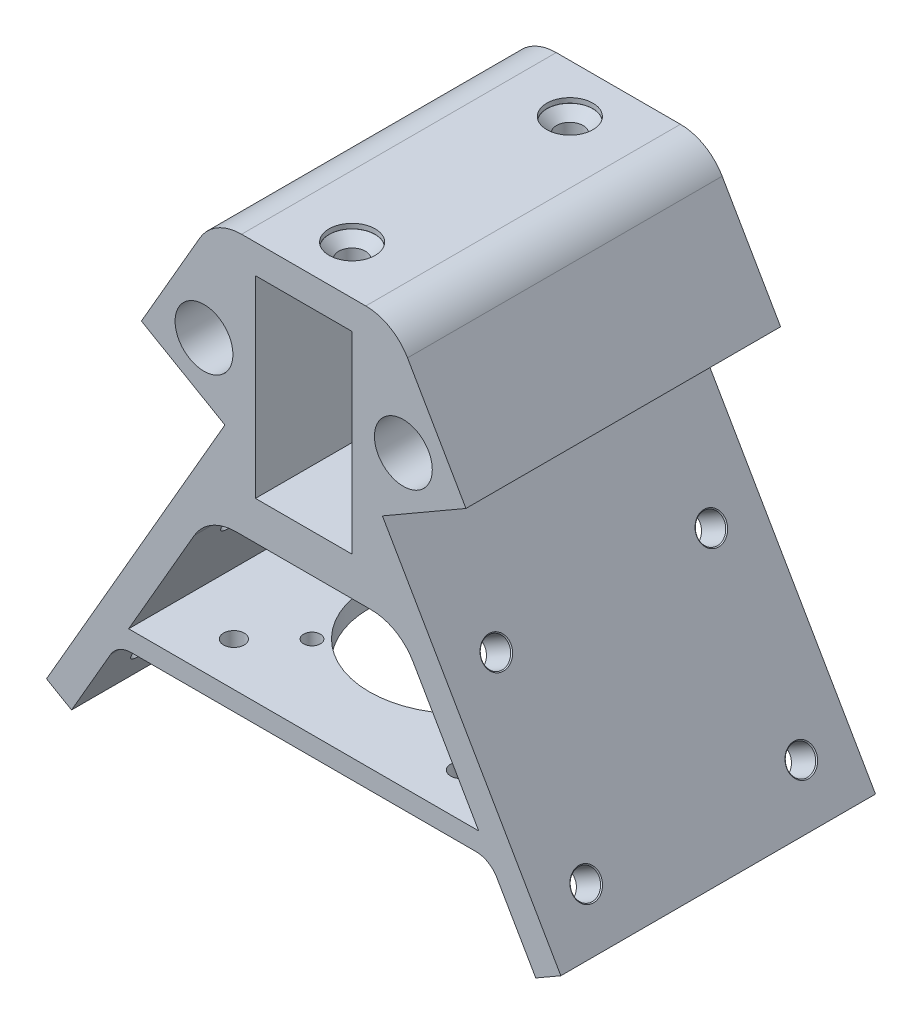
ISO-10303-21;
HEADER;
FILE_DESCRIPTION(('STEP AP214'),'2;1');
FILE_NAME('part.step','',(''),(''),'','','');
FILE_SCHEMA(('AUTOMOTIVE_DESIGN { 1 0 10303 214 1 1 1 1 }'));
ENDSEC;
DATA;
#1=APPLICATION_CONTEXT('core data for automotive mechanical design processes');
#2=APPLICATION_PROTOCOL_DEFINITION('international standard','automotive_design',2000,#1);
#3=PRODUCT_CONTEXT('',#1,'mechanical');
#4=PRODUCT('Part','Part','',(#3));
#5=PRODUCT_RELATED_PRODUCT_CATEGORY('part','',(#4));
#6=PRODUCT_DEFINITION_FORMATION('','',#4);
#7=PRODUCT_DEFINITION_CONTEXT('part definition',#1,'design');
#8=PRODUCT_DEFINITION('design','',#6,#7);
#9=PRODUCT_DEFINITION_SHAPE('','',#8);
#10=(LENGTH_UNIT() NAMED_UNIT(*) SI_UNIT(.MILLI.,.METRE.));
#11=(NAMED_UNIT(*) PLANE_ANGLE_UNIT() SI_UNIT($,.RADIAN.));
#12=(NAMED_UNIT(*) SI_UNIT($,.STERADIAN.) SOLID_ANGLE_UNIT());
#13=UNCERTAINTY_MEASURE_WITH_UNIT(LENGTH_MEASURE(1.E-05),#10,'distance_accuracy_value','');
#14=(GEOMETRIC_REPRESENTATION_CONTEXT(3) GLOBAL_UNCERTAINTY_ASSIGNED_CONTEXT((#13)) GLOBAL_UNIT_ASSIGNED_CONTEXT((#10,
#11,#12)) REPRESENTATION_CONTEXT('',''));
#15=CARTESIAN_POINT('',(0.,0.,0.));
#16=DIRECTION('',(0.,0.,1.));
#17=DIRECTION('',(1.,0.,0.));
#18=AXIS2_PLACEMENT_3D('',#15,#16,#17);
#19=CARTESIAN_POINT('',(23.5466558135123,100.067641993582,9.07834418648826));
#20=DIRECTION('',(0.,-1.,0.));
#21=DIRECTION('',(0.,0.,-1.));
#22=AXIS2_PLACEMENT_3D('',#19,#20,#21);
#23=CYLINDRICAL_SURFACE('',#22,2.15);
#24=CARTESIAN_POINT('',(23.5466558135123,17.5,9.07834418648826));
#25=DIRECTION('',(0.,1.,0.));
#26=DIRECTION('',(1.,0.,0.));
#27=AXIS2_PLACEMENT_3D('',#24,#25,#26);
#28=CIRCLE('',#27,2.15);
#29=CARTESIAN_POINT('',(25.6966558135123,17.5,9.07834418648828));
#30=VERTEX_POINT('',#29);
#31=EDGE_CURVE('E24',#30,#30,#28,.F.);
#32=ORIENTED_EDGE('',*,*,#31,.F.);
#33=EDGE_LOOP('',(#32));
#34=FACE_BOUND('',#33,.T.);
#35=CARTESIAN_POINT('',(23.5466558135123,13.5,9.07834418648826));
#36=DIRECTION('',(0.,-1.,0.));
#37=DIRECTION('',(0.,0.,-1.));
#38=AXIS2_PLACEMENT_3D('',#35,#36,#37);
#39=CIRCLE('',#38,2.15);
#40=CARTESIAN_POINT('',(23.5466558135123,13.5,6.92834418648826));
#41=VERTEX_POINT('',#40);
#42=EDGE_CURVE('E10',#41,#41,#39,.T.);
#43=ORIENTED_EDGE('',*,*,#42,.T.);
#44=EDGE_LOOP('',(#43));
#45=FACE_BOUND('',#44,.T.);
#46=ADVANCED_FACE('F16',(#34,#45),#23,.F.);
#47=CARTESIAN_POINT('',(15.4502831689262,100.067641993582,17.1747168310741));
#48=DIRECTION('',(0.,-1.,0.));
#49=DIRECTION('',(0.,0.,-1.));
#50=AXIS2_PLACEMENT_3D('',#47,#48,#49);
#51=CYLINDRICAL_SURFACE('',#50,1.75);
#52=CARTESIAN_POINT('',(15.4502831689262,17.5,17.1747168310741));
#53=DIRECTION('',(0.,1.,0.));
#54=DIRECTION('',(1.,0.,0.));
#55=AXIS2_PLACEMENT_3D('',#52,#53,#54);
#56=CIRCLE('',#55,1.75);
#57=CARTESIAN_POINT('',(17.2002831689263,17.5,17.1747168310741));
#58=VERTEX_POINT('',#57);
#59=EDGE_CURVE('E339',#58,#58,#56,.F.);
#60=ORIENTED_EDGE('',*,*,#59,.F.);
#61=EDGE_LOOP('',(#60));
#62=FACE_BOUND('',#61,.T.);
#63=CARTESIAN_POINT('',(15.4502831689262,13.5,17.1747168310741));
#64=DIRECTION('',(0.,-1.,0.));
#65=DIRECTION('',(0.,0.,-1.));
#66=AXIS2_PLACEMENT_3D('',#63,#64,#65);
#67=CIRCLE('',#66,1.75);
#68=CARTESIAN_POINT('',(15.4502831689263,13.5,15.4247168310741));
#69=VERTEX_POINT('',#68);
#70=EDGE_CURVE('E342',#69,#69,#67,.T.);
#71=ORIENTED_EDGE('',*,*,#70,.T.);
#72=EDGE_LOOP('',(#71));
#73=FACE_BOUND('',#72,.T.);
#74=ADVANCED_FACE('F352',(#62,#73),#51,.F.);
#75=CARTESIAN_POINT('',(-23.546655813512,100.067641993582,9.07834418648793));
#76=DIRECTION('',(0.,-1.,0.));
#77=DIRECTION('',(-1.,0.,0.));
#78=AXIS2_PLACEMENT_3D('',#75,#76,#77);
#79=CYLINDRICAL_SURFACE('',#78,2.15);
#80=CARTESIAN_POINT('',(-23.546655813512,17.5,9.07834418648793));
#81=DIRECTION('',(0.,1.,0.));
#82=DIRECTION('',(0.,0.,-1.));
#83=AXIS2_PLACEMENT_3D('',#80,#81,#82);
#84=CIRCLE('',#83,2.15);
#85=CARTESIAN_POINT('',(-23.546655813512,17.5,6.92834418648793));
#86=VERTEX_POINT('',#85);
#87=EDGE_CURVE('E333',#86,#86,#84,.F.);
#88=ORIENTED_EDGE('',*,*,#87,.F.);
#89=EDGE_LOOP('',(#88));
#90=FACE_BOUND('',#89,.T.);
#91=CARTESIAN_POINT('',(-23.546655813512,13.5,9.07834418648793));
#92=DIRECTION('',(0.,-1.,0.));
#93=DIRECTION('',(-1.,0.,0.));
#94=AXIS2_PLACEMENT_3D('',#91,#92,#93);
#95=CIRCLE('',#94,2.15);
#96=CARTESIAN_POINT('',(-25.696655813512,13.5,9.07834418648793));
#97=VERTEX_POINT('',#96);
#98=EDGE_CURVE('E336',#97,#97,#95,.T.);
#99=ORIENTED_EDGE('',*,*,#98,.T.);
#100=EDGE_LOOP('',(#99));
#101=FACE_BOUND('',#100,.T.);
#102=ADVANCED_FACE('F837',(#90,#101),#79,.F.);
#103=CARTESIAN_POINT('',(-15.450283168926,100.067641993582,17.1747168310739));
#104=DIRECTION('',(0.,-1.,0.));
#105=DIRECTION('',(-1.,0.,0.));
#106=AXIS2_PLACEMENT_3D('',#103,#104,#105);
#107=CYLINDRICAL_SURFACE('',#106,1.75);
#108=CARTESIAN_POINT('',(-15.450283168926,17.5,17.1747168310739));
#109=DIRECTION('',(0.,1.,0.));
#110=DIRECTION('',(0.,0.,-1.));
#111=AXIS2_PLACEMENT_3D('',#108,#109,#110);
#112=CIRCLE('',#111,1.75);
#113=CARTESIAN_POINT('',(-15.450283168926,17.5,15.4247168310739));
#114=VERTEX_POINT('',#113);
#115=EDGE_CURVE('E327',#114,#114,#112,.F.);
#116=ORIENTED_EDGE('',*,*,#115,.F.);
#117=EDGE_LOOP('',(#116));
#118=FACE_BOUND('',#117,.T.);
#119=CARTESIAN_POINT('',(-15.450283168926,13.5,17.1747168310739));
#120=DIRECTION('',(0.,-1.,0.));
#121=DIRECTION('',(-1.,0.,0.));
#122=AXIS2_PLACEMENT_3D('',#119,#120,#121);
#123=CIRCLE('',#122,1.75);
#124=CARTESIAN_POINT('',(-17.200283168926,13.5,17.1747168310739));
#125=VERTEX_POINT('',#124);
#126=EDGE_CURVE('E330',#125,#125,#123,.T.);
#127=ORIENTED_EDGE('',*,*,#126,.T.);
#128=EDGE_LOOP('',(#127));
#129=FACE_BOUND('',#128,.T.);
#130=ADVANCED_FACE('F833',(#118,#129),#107,.F.);
#131=CARTESIAN_POINT('',(-23.5466558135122,100.067641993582,56.1716558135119));
#132=DIRECTION('',(0.,-1.,0.));
#133=DIRECTION('',(0.,0.,1.));
#134=AXIS2_PLACEMENT_3D('',#131,#132,#133);
#135=CYLINDRICAL_SURFACE('',#134,2.15);
#136=CARTESIAN_POINT('',(-23.5466558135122,17.5,56.1716558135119));
#137=DIRECTION('',(0.,1.,0.));
#138=DIRECTION('',(-1.,0.,0.));
#139=AXIS2_PLACEMENT_3D('',#136,#137,#138);
#140=CIRCLE('',#139,2.15);
#141=CARTESIAN_POINT('',(-25.6966558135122,17.5,56.1716558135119));
#142=VERTEX_POINT('',#141);
#143=EDGE_CURVE('E321',#142,#142,#140,.F.);
#144=ORIENTED_EDGE('',*,*,#143,.F.);
#145=EDGE_LOOP('',(#144));
#146=FACE_BOUND('',#145,.T.);
#147=CARTESIAN_POINT('',(-23.5466558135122,13.5,56.1716558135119));
#148=DIRECTION('',(0.,-1.,0.));
#149=DIRECTION('',(0.,0.,1.));
#150=AXIS2_PLACEMENT_3D('',#147,#148,#149);
#151=CIRCLE('',#150,2.15);
#152=CARTESIAN_POINT('',(-23.5466558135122,13.5,58.3216558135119));
#153=VERTEX_POINT('',#152);
#154=EDGE_CURVE('E324',#153,#153,#151,.T.);
#155=ORIENTED_EDGE('',*,*,#154,.T.);
#156=EDGE_LOOP('',(#155));
#157=FACE_BOUND('',#156,.T.);
#158=ADVANCED_FACE('F829',(#146,#157),#135,.F.);
#159=CARTESIAN_POINT('',(-15.4502831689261,100.067641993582,48.075283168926));
#160=DIRECTION('',(0.,-1.,0.));
#161=DIRECTION('',(0.,0.,1.));
#162=AXIS2_PLACEMENT_3D('',#159,#160,#161);
#163=CYLINDRICAL_SURFACE('',#162,1.75);
#164=CARTESIAN_POINT('',(-15.4502831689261,17.5,48.075283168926));
#165=DIRECTION('',(0.,1.,0.));
#166=DIRECTION('',(-1.,0.,0.));
#167=AXIS2_PLACEMENT_3D('',#164,#165,#166);
#168=CIRCLE('',#167,1.75);
#169=CARTESIAN_POINT('',(-17.2002831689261,17.5,48.075283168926));
#170=VERTEX_POINT('',#169);
#171=EDGE_CURVE('E315',#170,#170,#168,.F.);
#172=ORIENTED_EDGE('',*,*,#171,.F.);
#173=EDGE_LOOP('',(#172));
#174=FACE_BOUND('',#173,.T.);
#175=CARTESIAN_POINT('',(-15.4502831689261,13.5,48.075283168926));
#176=DIRECTION('',(0.,-1.,0.));
#177=DIRECTION('',(0.,0.,1.));
#178=AXIS2_PLACEMENT_3D('',#175,#176,#177);
#179=CIRCLE('',#178,1.75);
#180=CARTESIAN_POINT('',(-15.4502831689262,13.5,49.825283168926));
#181=VERTEX_POINT('',#180);
#182=EDGE_CURVE('E318',#181,#181,#179,.T.);
#183=ORIENTED_EDGE('',*,*,#182,.T.);
#184=EDGE_LOOP('',(#183));
#185=FACE_BOUND('',#184,.T.);
#186=ADVANCED_FACE('F702',(#174,#185),#163,.F.);
#187=CARTESIAN_POINT('',(0.,-3.00100000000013,10.05));
#188=DIRECTION('',(0.,1.,0.));
#189=DIRECTION('',(-1.,0.,0.));
#190=AXIS2_PLACEMENT_3D('',#187,#188,#189);
#191=CYLINDRICAL_SURFACE('',#190,2.75);
#192=CARTESIAN_POINT('',(1.58152745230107E-13,97.0666419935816,10.05));
#193=DIRECTION('',(0.,1.,0.));
#194=DIRECTION('',(-1.,0.,0.));
#195=AXIS2_PLACEMENT_3D('',#192,#193,#194);
#196=CIRCLE('',#195,2.75);
#197=CARTESIAN_POINT('',(-2.74999999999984,97.0666419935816,10.05));
#198=VERTEX_POINT('',#197);
#199=EDGE_CURVE('E282',#198,#198,#196,.T.);
#200=ORIENTED_EDGE('',*,*,#199,.T.);
#201=EDGE_LOOP('',(#200));
#202=FACE_BOUND('',#201,.T.);
#203=CARTESIAN_POINT('',(1.53302820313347E-13,94.0666419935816,10.05));
#204=DIRECTION('',(0.,1.,0.));
#205=DIRECTION('',(0.,0.,1.));
#206=AXIS2_PLACEMENT_3D('',#203,#204,#205);
#207=CIRCLE('',#206,2.75);
#208=CARTESIAN_POINT('',(1.53302820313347E-13,94.0666419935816,12.8));
#209=VERTEX_POINT('',#208);
#210=EDGE_CURVE('E472',#209,#209,#207,.F.);
#211=ORIENTED_EDGE('',*,*,#210,.T.);
#212=EDGE_LOOP('',(#211));
#213=FACE_BOUND('',#212,.T.);
#214=ADVANCED_FACE('F698',(#202,#213),#191,.F.);
#215=CARTESIAN_POINT('',(0.,-3.00100000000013,55.2));
#216=DIRECTION('',(0.,1.,0.));
#217=DIRECTION('',(-1.,0.,0.));
#218=AXIS2_PLACEMENT_3D('',#215,#216,#217);
#219=CYLINDRICAL_SURFACE('',#218,2.75);
#220=CARTESIAN_POINT('',(1.57258753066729E-13,97.0666419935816,55.2));
#221=DIRECTION('',(0.,1.,0.));
#222=DIRECTION('',(-1.,0.,0.));
#223=AXIS2_PLACEMENT_3D('',#220,#221,#222);
#224=CIRCLE('',#223,2.75);
#225=CARTESIAN_POINT('',(-2.74999999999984,97.0666419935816,55.2));
#226=VERTEX_POINT('',#225);
#227=EDGE_CURVE('E288',#226,#226,#224,.T.);
#228=ORIENTED_EDGE('',*,*,#227,.T.);
#229=EDGE_LOOP('',(#228));
#230=FACE_BOUND('',#229,.T.);
#231=CARTESIAN_POINT('',(1.52408828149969E-13,94.0666419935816,55.2));
#232=DIRECTION('',(0.,1.,0.));
#233=DIRECTION('',(0.,0.,1.));
#234=AXIS2_PLACEMENT_3D('',#231,#232,#233);
#235=CIRCLE('',#234,2.75);
#236=CARTESIAN_POINT('',(1.52408828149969E-13,94.0666419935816,57.95));
#237=VERTEX_POINT('',#236);
#238=EDGE_CURVE('E530',#237,#237,#235,.F.);
#239=ORIENTED_EDGE('',*,*,#238,.T.);
#240=EDGE_LOOP('',(#239));
#241=FACE_BOUND('',#240,.T.);
#242=ADVANCED_FACE('F694',(#230,#241),#219,.F.);
#243=CARTESIAN_POINT('',(14.031197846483,36.0666419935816,65.25));
#244=DIRECTION('',(0.,0.,-1.));
#245=DIRECTION('',(-1.,0.,0.));
#246=AXIS2_PLACEMENT_3D('',#243,#244,#245);
#247=CYLINDRICAL_SURFACE('',#246,10.);
#248=CARTESIAN_POINT('',(14.031197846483,36.0666419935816,0.));
#249=DIRECTION('',(0.,0.,1.));
#250=DIRECTION('',(1.,0.,0.));
#251=AXIS2_PLACEMENT_3D('',#248,#249,#250);
#252=CIRCLE('',#251,10.);
#253=CARTESIAN_POINT('',(22.6914518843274,41.0666419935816,0.));
#254=VERTEX_POINT('',#253);
#255=CARTESIAN_POINT('',(14.0311978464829,46.0666419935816,0.));
#256=VERTEX_POINT('',#255);
#257=EDGE_CURVE('E447',#254,#256,#252,.T.);
#258=ORIENTED_EDGE('',*,*,#257,.F.);
#259=DIRECTION('',(0.,0.,-1.));
#260=VECTOR('',#259,1.);
#261=CARTESIAN_POINT('',(22.6914518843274,41.0666419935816,65.25));
#262=LINE('',#261,#260);
#263=CARTESIAN_POINT('',(22.6914518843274,41.0666419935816,65.25));
#264=VERTEX_POINT('',#263);
#265=EDGE_CURVE('E229',#264,#254,#262,.T.);
#266=ORIENTED_EDGE('',*,*,#265,.F.);
#267=CARTESIAN_POINT('',(14.031197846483,36.0666419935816,65.25));
#268=DIRECTION('',(0.,0.,1.));
#269=DIRECTION('',(1.,0.,0.));
#270=AXIS2_PLACEMENT_3D('',#267,#268,#269);
#271=CIRCLE('',#270,10.);
#272=CARTESIAN_POINT('',(14.0311978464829,46.0666419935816,65.25));
#273=VERTEX_POINT('',#272);
#274=EDGE_CURVE('E519',#264,#273,#271,.T.);
#275=ORIENTED_EDGE('',*,*,#274,.T.);
#276=DIRECTION('',(0.,0.,-1.));
#277=VECTOR('',#276,1.);
#278=CARTESIAN_POINT('',(14.0311978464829,46.0666419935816,65.25));
#279=LINE('',#278,#277);
#280=EDGE_CURVE('E121',#273,#256,#279,.T.);
#281=ORIENTED_EDGE('',*,*,#280,.T.);
#282=EDGE_LOOP('',(#258,#266,#275,#281));
#283=FACE_BOUND('',#282,.T.);
#284=ADVANCED_FACE('F697',(#283),#247,.F.);
#285=CARTESIAN_POINT('',(34.8009665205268,20.0923473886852,65.25));
#286=DIRECTION('',(-0.86602540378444,-0.499999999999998,0.));
#287=DIRECTION('',(0.499999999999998,-0.86602540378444,0.));
#288=AXIS2_PLACEMENT_3D('',#285,#286,#287);
#289=PLANE('',#288);
#290=CARTESIAN_POINT('',(24.4208395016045,38.071254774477,10.325));
#291=DIRECTION('',(-0.866025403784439,-0.499999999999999,0.));
#292=DIRECTION('',(0.499999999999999,-0.866025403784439,0.));
#293=AXIS2_PLACEMENT_3D('',#290,#291,#292);
#294=CIRCLE('',#293,2.825);
#295=CARTESIAN_POINT('',(25.8333395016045,35.6247330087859,10.325));
#296=VERTEX_POINT('',#295);
#297=EDGE_CURVE('E591',#296,#296,#294,.F.);
#298=ORIENTED_EDGE('',*,*,#297,.T.);
#299=EDGE_LOOP('',(#298));
#300=FACE_BOUND('',#299,.T.);
#301=CARTESIAN_POINT('',(24.4208395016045,38.071254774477,54.925));
#302=DIRECTION('',(-0.866025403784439,-0.499999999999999,0.));
#303=DIRECTION('',(0.499999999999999,-0.866025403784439,0.));
#304=AXIS2_PLACEMENT_3D('',#301,#302,#303);
#305=CIRCLE('',#304,2.825);
#306=CARTESIAN_POINT('',(25.8333395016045,35.6247330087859,54.925));
#307=VERTEX_POINT('',#306);
#308=EDGE_CURVE('E564',#307,#307,#305,.F.);
#309=ORIENTED_EDGE('',*,*,#308,.T.);
#310=EDGE_LOOP('',(#309));
#311=FACE_BOUND('',#310,.T.);
#312=DIRECTION('',(-0.499999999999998,0.86602540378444,0.));
#313=VECTOR('',#312,1.);
#314=CARTESIAN_POINT('',(34.8009665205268,20.0923473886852,0.));
#315=LINE('',#314,#313);
#316=CARTESIAN_POINT('',(36.2976589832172,17.5,0.));
#317=VERTEX_POINT('',#316);
#318=EDGE_CURVE('E449',#317,#254,#315,.T.);
#319=ORIENTED_EDGE('',*,*,#318,.F.);
#320=DIRECTION('',(0.,0.,-1.));
#321=VECTOR('',#320,1.);
#322=CARTESIAN_POINT('',(36.2976589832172,17.5,65.25));
#323=LINE('',#322,#321);
#324=CARTESIAN_POINT('',(36.2976589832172,17.5,65.25));
#325=VERTEX_POINT('',#324);
#326=EDGE_CURVE('E223',#325,#317,#323,.T.);
#327=ORIENTED_EDGE('',*,*,#326,.F.);
#328=DIRECTION('',(-0.499999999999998,0.86602540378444,0.));
#329=VECTOR('',#328,1.);
#330=CARTESIAN_POINT('',(34.8009665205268,20.0923473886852,65.25));
#331=LINE('',#330,#329);
#332=EDGE_CURVE('E521',#325,#264,#331,.T.);
#333=ORIENTED_EDGE('',*,*,#332,.T.);
#334=ORIENTED_EDGE('',*,*,#265,.T.);
#335=EDGE_LOOP('',(#319,#327,#333,#334));
#336=FACE_BOUND('',#335,.T.);
#337=ADVANCED_FACE('F732',(#300,#311,#336),#289,.T.);
#338=CARTESIAN_POINT('',(0.,17.5,65.25));
#339=DIRECTION('',(0.,1.,0.));
#340=DIRECTION('',(0.,0.,1.));
#341=AXIS2_PLACEMENT_3D('',#338,#339,#340);
#342=PLANE('',#341);
#343=ORIENTED_EDGE('',*,*,#59,.T.);
#344=EDGE_LOOP('',(#343));
#345=FACE_BOUND('',#344,.T.);
#346=ORIENTED_EDGE('',*,*,#31,.T.);
#347=EDGE_LOOP('',(#346));
#348=FACE_BOUND('',#347,.T.);
#349=ORIENTED_EDGE('',*,*,#115,.T.);
#350=EDGE_LOOP('',(#349));
#351=FACE_BOUND('',#350,.T.);
#352=ORIENTED_EDGE('',*,*,#87,.T.);
#353=EDGE_LOOP('',(#352));
#354=FACE_BOUND('',#353,.T.);
#355=ORIENTED_EDGE('',*,*,#171,.T.);
#356=EDGE_LOOP('',(#355));
#357=FACE_BOUND('',#356,.T.);
#358=ORIENTED_EDGE('',*,*,#143,.T.);
#359=EDGE_LOOP('',(#358));
#360=FACE_BOUND('',#359,.T.);
#361=CARTESIAN_POINT('',(23.546655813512,17.5,56.1716558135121));
#362=DIRECTION('',(0.,1.,0.));
#363=DIRECTION('',(0.,0.,1.));
#364=AXIS2_PLACEMENT_3D('',#361,#362,#363);
#365=CIRCLE('',#364,2.15);
#366=CARTESIAN_POINT('',(23.546655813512,17.5,58.3216558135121));
#367=VERTEX_POINT('',#366);
#368=EDGE_CURVE('E602',#367,#367,#365,.F.);
#369=ORIENTED_EDGE('',*,*,#368,.T.);
#370=EDGE_LOOP('',(#369));
#371=FACE_BOUND('',#370,.T.);
#372=CARTESIAN_POINT('',(15.450283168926,17.5,48.0752831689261));
#373=DIRECTION('',(0.,1.,0.));
#374=DIRECTION('',(0.,0.,1.));
#375=AXIS2_PLACEMENT_3D('',#372,#373,#374);
#376=CIRCLE('',#375,1.75);
#377=CARTESIAN_POINT('',(15.450283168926,17.5,49.8252831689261));
#378=VERTEX_POINT('',#377);
#379=EDGE_CURVE('E601',#378,#378,#376,.F.);
#380=ORIENTED_EDGE('',*,*,#379,.T.);
#381=EDGE_LOOP('',(#380));
#382=FACE_BOUND('',#381,.T.);
#383=CARTESIAN_POINT('',(0.,17.5,32.625));
#384=DIRECTION('',(0.,1.,0.));
#385=DIRECTION('',(0.,0.,1.));
#386=AXIS2_PLACEMENT_3D('',#383,#384,#385);
#387=CIRCLE('',#386,19.);
#388=CARTESIAN_POINT('',(0.,17.5,51.625));
#389=VERTEX_POINT('',#388);
#390=EDGE_CURVE('E598',#389,#389,#387,.F.);
#391=ORIENTED_EDGE('',*,*,#390,.T.);
#392=EDGE_LOOP('',(#391));
#393=FACE_BOUND('',#392,.T.);
#394=DIRECTION('',(1.,0.,0.));
#395=VECTOR('',#394,1.);
#396=CARTESIAN_POINT('',(0.,17.5,0.));
#397=LINE('',#396,#395);
#398=CARTESIAN_POINT('',(-36.2976589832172,17.5,0.));
#399=VERTEX_POINT('',#398);
#400=EDGE_CURVE('E452',#399,#317,#397,.T.);
#401=ORIENTED_EDGE('',*,*,#400,.F.);
#402=DIRECTION('',(0.,0.,-1.));
#403=VECTOR('',#402,1.);
#404=CARTESIAN_POINT('',(-36.2976589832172,17.5,65.25));
#405=LINE('',#404,#403);
#406=CARTESIAN_POINT('',(-36.2976589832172,17.5,65.25));
#407=VERTEX_POINT('',#406);
#408=EDGE_CURVE('E221',#407,#399,#405,.T.);
#409=ORIENTED_EDGE('',*,*,#408,.F.);
#410=DIRECTION('',(1.,0.,0.));
#411=VECTOR('',#410,1.);
#412=CARTESIAN_POINT('',(0.,17.5,65.25));
#413=LINE('',#412,#411);
#414=EDGE_CURVE('E215',#407,#325,#413,.T.);
#415=ORIENTED_EDGE('',*,*,#414,.T.);
#416=ORIENTED_EDGE('',*,*,#326,.T.);
#417=EDGE_LOOP('',(#401,#409,#415,#416));
#418=FACE_BOUND('',#417,.T.);
#419=ADVANCED_FACE('F347',(#345,#348,#351,#354,#357,#360,#371,#382,#393,#418),#342,.T.);
#420=CARTESIAN_POINT('',(-34.8009665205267,20.0923473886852,65.25));
#421=DIRECTION('',(-0.866025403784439,0.499999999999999,0.));
#422=DIRECTION('',(-0.499999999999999,-0.866025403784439,0.));
#423=AXIS2_PLACEMENT_3D('',#420,#421,#422);
#424=PLANE('',#423);
#425=CARTESIAN_POINT('',(-24.4208395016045,38.071254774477,54.925));
#426=DIRECTION('',(-0.866025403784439,0.499999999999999,0.));
#427=DIRECTION('',(-0.499999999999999,-0.866025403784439,0.));
#428=AXIS2_PLACEMENT_3D('',#425,#426,#427);
#429=CIRCLE('',#428,2.825);
#430=CARTESIAN_POINT('',(-25.8333395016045,35.6247330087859,54.925));
#431=VERTEX_POINT('',#430);
#432=EDGE_CURVE('E556',#431,#431,#429,.F.);
#433=ORIENTED_EDGE('',*,*,#432,.F.);
#434=EDGE_LOOP('',(#433));
#435=FACE_BOUND('',#434,.T.);
#436=CARTESIAN_POINT('',(-24.4208395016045,38.071254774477,10.325));
#437=DIRECTION('',(-0.866025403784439,0.499999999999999,0.));
#438=DIRECTION('',(-0.499999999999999,-0.866025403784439,0.));
#439=AXIS2_PLACEMENT_3D('',#436,#437,#438);
#440=CIRCLE('',#439,2.825);
#441=CARTESIAN_POINT('',(-25.8333395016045,35.6247330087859,10.325));
#442=VERTEX_POINT('',#441);
#443=EDGE_CURVE('E552',#442,#442,#440,.F.);
#444=ORIENTED_EDGE('',*,*,#443,.F.);
#445=EDGE_LOOP('',(#444));
#446=FACE_BOUND('',#445,.T.);
#447=DIRECTION('',(0.499999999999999,0.866025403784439,0.));
#448=VECTOR('',#447,1.);
#449=CARTESIAN_POINT('',(-34.8009665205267,20.0923473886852,0.));
#450=LINE('',#449,#448);
#451=CARTESIAN_POINT('',(-22.6914518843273,41.0666419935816,0.));
#452=VERTEX_POINT('',#451);
#453=EDGE_CURVE('E220',#399,#452,#450,.T.);
#454=ORIENTED_EDGE('',*,*,#453,.T.);
#455=DIRECTION('',(0.,0.,-1.));
#456=VECTOR('',#455,1.);
#457=CARTESIAN_POINT('',(-22.6914518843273,41.0666419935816,65.25));
#458=LINE('',#457,#456);
#459=CARTESIAN_POINT('',(-22.6914518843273,41.0666419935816,65.25));
#460=VERTEX_POINT('',#459);
#461=EDGE_CURVE('E204',#460,#452,#458,.T.);
#462=ORIENTED_EDGE('',*,*,#461,.F.);
#463=DIRECTION('',(0.499999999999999,0.866025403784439,0.));
#464=VECTOR('',#463,1.);
#465=CARTESIAN_POINT('',(-34.8009665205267,20.0923473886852,65.25));
#466=LINE('',#465,#464);
#467=EDGE_CURVE('E207',#407,#460,#466,.T.);
#468=ORIENTED_EDGE('',*,*,#467,.F.);
#469=ORIENTED_EDGE('',*,*,#408,.T.);
#470=EDGE_LOOP('',(#454,#462,#468,#469));
#471=FACE_BOUND('',#470,.T.);
#472=ADVANCED_FACE('F218',(#435,#446,#471),#424,.F.);
#473=CARTESIAN_POINT('',(-14.031197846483,36.0666419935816,65.25));
#474=DIRECTION('',(0.,0.,-1.));
#475=DIRECTION('',(-1.,0.,0.));
#476=AXIS2_PLACEMENT_3D('',#473,#474,#475);
#477=CYLINDRICAL_SURFACE('',#476,9.99999999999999);
#478=CARTESIAN_POINT('',(-14.031197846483,36.0666419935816,0.));
#479=DIRECTION('',(0.,0.,1.));
#480=DIRECTION('',(1.,0.,0.));
#481=AXIS2_PLACEMENT_3D('',#478,#479,#480);
#482=CIRCLE('',#481,9.99999999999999);
#483=CARTESIAN_POINT('',(-14.0311978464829,46.0666419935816,0.));
#484=VERTEX_POINT('',#483);
#485=EDGE_CURVE('E456',#452,#484,#482,.F.);
#486=ORIENTED_EDGE('',*,*,#485,.T.);
#487=DIRECTION('',(0.,0.,-1.));
#488=VECTOR('',#487,1.);
#489=CARTESIAN_POINT('',(-14.0311978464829,46.0666419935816,65.25));
#490=LINE('',#489,#488);
#491=CARTESIAN_POINT('',(-14.0311978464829,46.0666419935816,65.25));
#492=VERTEX_POINT('',#491);
#493=EDGE_CURVE('E206',#492,#484,#490,.T.);
#494=ORIENTED_EDGE('',*,*,#493,.F.);
#495=CARTESIAN_POINT('',(-14.031197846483,36.0666419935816,65.25));
#496=DIRECTION('',(0.,0.,1.));
#497=DIRECTION('',(1.,0.,0.));
#498=AXIS2_PLACEMENT_3D('',#495,#496,#497);
#499=CIRCLE('',#498,9.99999999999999);
#500=EDGE_CURVE('E199',#460,#492,#499,.F.);
#501=ORIENTED_EDGE('',*,*,#500,.F.);
#502=ORIENTED_EDGE('',*,*,#461,.T.);
#503=EDGE_LOOP('',(#486,#494,#501,#502));
#504=FACE_BOUND('',#503,.T.);
#505=ADVANCED_FACE('F202',(#504),#477,.F.);
#506=CARTESIAN_POINT('',(0.,94.0666419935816,65.25));
#507=DIRECTION('',(0.,1.,0.));
#508=DIRECTION('',(0.,0.,1.));
#509=AXIS2_PLACEMENT_3D('',#506,#507,#508);
#510=PLANE('',#509);
#511=ORIENTED_EDGE('',*,*,#238,.F.);
#512=EDGE_LOOP('',(#511));
#513=FACE_BOUND('',#512,.T.);
#514=ORIENTED_EDGE('',*,*,#210,.F.);
#515=EDGE_LOOP('',(#514));
#516=FACE_BOUND('',#515,.T.);
#517=DIRECTION('',(1.,0.,0.));
#518=VECTOR('',#517,1.);
#519=CARTESIAN_POINT('',(0.,94.0666419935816,0.));
#520=LINE('',#519,#518);
#521=CARTESIAN_POINT('',(-10.,94.0666419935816,0.));
#522=VERTEX_POINT('',#521);
#523=CARTESIAN_POINT('',(9.99999999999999,94.0666419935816,0.));
#524=VERTEX_POINT('',#523);
#525=EDGE_CURVE('E435',#522,#524,#520,.T.);
#526=ORIENTED_EDGE('',*,*,#525,.T.);
#527=DIRECTION('',(0.,0.,-1.));
#528=VECTOR('',#527,1.);
#529=CARTESIAN_POINT('',(9.99999999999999,94.0666419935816,65.25));
#530=LINE('',#529,#528);
#531=CARTESIAN_POINT('',(9.99999999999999,94.0666419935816,65.25));
#532=VERTEX_POINT('',#531);
#533=EDGE_CURVE('E238',#532,#524,#530,.T.);
#534=ORIENTED_EDGE('',*,*,#533,.F.);
#535=DIRECTION('',(1.,0.,0.));
#536=VECTOR('',#535,1.);
#537=CARTESIAN_POINT('',(0.,94.0666419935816,65.25));
#538=LINE('',#537,#536);
#539=CARTESIAN_POINT('',(-10.,94.0666419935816,65.25));
#540=VERTEX_POINT('',#539);
#541=EDGE_CURVE('E508',#540,#532,#538,.T.);
#542=ORIENTED_EDGE('',*,*,#541,.F.);
#543=DIRECTION('',(0.,0.,-1.));
#544=VECTOR('',#543,1.);
#545=CARTESIAN_POINT('',(-10.,94.0666419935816,65.25));
#546=LINE('',#545,#544);
#547=EDGE_CURVE('E232',#540,#522,#546,.T.);
#548=ORIENTED_EDGE('',*,*,#547,.T.);
#549=EDGE_LOOP('',(#526,#534,#542,#548));
#550=FACE_BOUND('',#549,.T.);
#551=ADVANCED_FACE('F726',(#513,#516,#550),#510,.F.);
#552=CARTESIAN_POINT('',(10.,0.,65.25));
#553=DIRECTION('',(1.,0.,0.));
#554=DIRECTION('',(0.,1.,0.));
#555=AXIS2_PLACEMENT_3D('',#552,#553,#554);
#556=PLANE('',#555);
#557=DIRECTION('',(0.,-1.,0.));
#558=VECTOR('',#557,1.);
#559=CARTESIAN_POINT('',(10.,0.,0.));
#560=LINE('',#559,#558);
#561=CARTESIAN_POINT('',(9.99999999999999,54.0666419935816,0.));
#562=VERTEX_POINT('',#561);
#563=EDGE_CURVE('E438',#524,#562,#560,.T.);
#564=ORIENTED_EDGE('',*,*,#563,.T.);
#565=DIRECTION('',(0.,0.,-1.));
#566=VECTOR('',#565,1.);
#567=CARTESIAN_POINT('',(9.99999999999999,54.0666419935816,65.25));
#568=LINE('',#567,#566);
#569=CARTESIAN_POINT('',(9.99999999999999,54.0666419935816,65.25));
#570=VERTEX_POINT('',#569);
#571=EDGE_CURVE('E236',#570,#562,#568,.T.);
#572=ORIENTED_EDGE('',*,*,#571,.F.);
#573=DIRECTION('',(0.,-1.,0.));
#574=VECTOR('',#573,1.);
#575=CARTESIAN_POINT('',(10.,0.,65.25));
#576=LINE('',#575,#574);
#577=EDGE_CURVE('E511',#532,#570,#576,.T.);
#578=ORIENTED_EDGE('',*,*,#577,.F.);
#579=ORIENTED_EDGE('',*,*,#533,.T.);
#580=EDGE_LOOP('',(#564,#572,#578,#579));
#581=FACE_BOUND('',#580,.T.);
#582=ADVANCED_FACE('F745',(#581),#556,.F.);
#583=CARTESIAN_POINT('',(0.,54.0666419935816,65.25));
#584=DIRECTION('',(0.,1.,0.));
#585=DIRECTION('',(0.,0.,1.));
#586=AXIS2_PLACEMENT_3D('',#583,#584,#585);
#587=PLANE('',#586);
#588=DIRECTION('',(1.,0.,0.));
#589=VECTOR('',#588,1.);
#590=CARTESIAN_POINT('',(0.,54.0666419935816,0.));
#591=LINE('',#590,#589);
#592=CARTESIAN_POINT('',(-10.,54.0666419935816,0.));
#593=VERTEX_POINT('',#592);
#594=EDGE_CURVE('E441',#593,#562,#591,.T.);
#595=ORIENTED_EDGE('',*,*,#594,.F.);
#596=DIRECTION('',(0.,0.,-1.));
#597=VECTOR('',#596,1.);
#598=CARTESIAN_POINT('',(-10.,54.0666419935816,65.25));
#599=LINE('',#598,#597);
#600=CARTESIAN_POINT('',(-10.,54.0666419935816,65.25));
#601=VERTEX_POINT('',#600);
#602=EDGE_CURVE('E234',#601,#593,#599,.T.);
#603=ORIENTED_EDGE('',*,*,#602,.F.);
#604=DIRECTION('',(1.,0.,0.));
#605=VECTOR('',#604,1.);
#606=CARTESIAN_POINT('',(0.,54.0666419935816,65.25));
#607=LINE('',#606,#605);
#608=EDGE_CURVE('E513',#601,#570,#607,.T.);
#609=ORIENTED_EDGE('',*,*,#608,.T.);
#610=ORIENTED_EDGE('',*,*,#571,.T.);
#611=EDGE_LOOP('',(#595,#603,#609,#610));
#612=FACE_BOUND('',#611,.T.);
#613=ADVANCED_FACE('F742',(#612),#587,.T.);
#614=CARTESIAN_POINT('',(-35.7203087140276,8.49999999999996,65.25));
#615=DIRECTION('',(0.,0.,-1.));
#616=DIRECTION('',(-1.,0.,0.));
#617=AXIS2_PLACEMENT_3D('',#614,#615,#616);
#618=CYLINDRICAL_SURFACE('',#617,5.);
#619=CARTESIAN_POINT('',(-35.7203087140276,8.49999999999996,0.));
#620=DIRECTION('',(0.,0.,1.));
#621=DIRECTION('',(1.,0.,0.));
#622=AXIS2_PLACEMENT_3D('',#619,#620,#621);
#623=CIRCLE('',#622,5.);
#624=CARTESIAN_POINT('',(-35.7203087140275,13.5,0.));
#625=VERTEX_POINT('',#624);
#626=CARTESIAN_POINT('',(-40.0504357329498,10.9999999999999,0.));
#627=VERTEX_POINT('',#626);
#628=EDGE_CURVE('E390',#625,#627,#623,.T.);
#629=ORIENTED_EDGE('',*,*,#628,.F.);
#630=DIRECTION('',(0.,0.,-1.));
#631=VECTOR('',#630,1.);
#632=CARTESIAN_POINT('',(-35.7203087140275,13.5,65.25));
#633=LINE('',#632,#631);
#634=CARTESIAN_POINT('',(-35.7203087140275,13.5,65.25));
#635=VERTEX_POINT('',#634);
#636=EDGE_CURVE('E128',#635,#625,#633,.T.);
#637=ORIENTED_EDGE('',*,*,#636,.F.);
#638=CARTESIAN_POINT('',(-35.7203087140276,8.49999999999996,65.25));
#639=DIRECTION('',(0.,0.,1.));
#640=DIRECTION('',(1.,0.,0.));
#641=AXIS2_PLACEMENT_3D('',#638,#639,#640);
#642=CIRCLE('',#641,5.);
#643=CARTESIAN_POINT('',(-40.0504357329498,10.9999999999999,65.25));
#644=VERTEX_POINT('',#643);
#645=EDGE_CURVE('E464',#635,#644,#642,.T.);
#646=ORIENTED_EDGE('',*,*,#645,.T.);
#647=DIRECTION('',(0.,0.,-1.));
#648=VECTOR('',#647,1.);
#649=CARTESIAN_POINT('',(-40.0504357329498,10.9999999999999,65.25));
#650=LINE('',#649,#648);
#651=EDGE_CURVE('E241',#644,#627,#650,.T.);
#652=ORIENTED_EDGE('',*,*,#651,.T.);
#653=EDGE_LOOP('',(#629,#637,#646,#652));
#654=FACE_BOUND('',#653,.T.);
#655=ADVANCED_FACE('F359',(#654),#618,.F.);
#656=CARTESIAN_POINT('',(0.,13.5,65.25));
#657=DIRECTION('',(0.,1.,0.));
#658=DIRECTION('',(-1.,0.,0.));
#659=AXIS2_PLACEMENT_3D('',#656,#657,#658);
#660=PLANE('',#659);
#661=ORIENTED_EDGE('',*,*,#70,.F.);
#662=EDGE_LOOP('',(#661));
#663=FACE_BOUND('',#662,.T.);
#664=ORIENTED_EDGE('',*,*,#42,.F.);
#665=EDGE_LOOP('',(#664));
#666=FACE_BOUND('',#665,.T.);
#667=ORIENTED_EDGE('',*,*,#126,.F.);
#668=EDGE_LOOP('',(#667));
#669=FACE_BOUND('',#668,.T.);
#670=ORIENTED_EDGE('',*,*,#98,.F.);
#671=EDGE_LOOP('',(#670));
#672=FACE_BOUND('',#671,.T.);
#673=ORIENTED_EDGE('',*,*,#182,.F.);
#674=EDGE_LOOP('',(#673));
#675=FACE_BOUND('',#674,.T.);
#676=ORIENTED_EDGE('',*,*,#154,.F.);
#677=EDGE_LOOP('',(#676));
#678=FACE_BOUND('',#677,.T.);
#679=CARTESIAN_POINT('',(23.546655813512,13.5,56.1716558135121));
#680=DIRECTION('',(0.,-1.,0.));
#681=DIRECTION('',(1.,0.,0.));
#682=AXIS2_PLACEMENT_3D('',#679,#680,#681);
#683=CIRCLE('',#682,2.15);
#684=CARTESIAN_POINT('',(25.696655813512,13.5,56.1716558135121));
#685=VERTEX_POINT('',#684);
#686=EDGE_CURVE('E373',#685,#685,#683,.T.);
#687=ORIENTED_EDGE('',*,*,#686,.F.);
#688=EDGE_LOOP('',(#687));
#689=FACE_BOUND('',#688,.T.);
#690=CARTESIAN_POINT('',(15.450283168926,13.5,48.0752831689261));
#691=DIRECTION('',(0.,-1.,0.));
#692=DIRECTION('',(1.,0.,0.));
#693=AXIS2_PLACEMENT_3D('',#690,#691,#692);
#694=CIRCLE('',#693,1.75);
#695=CARTESIAN_POINT('',(17.200283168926,13.5,48.0752831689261));
#696=VERTEX_POINT('',#695);
#697=EDGE_CURVE('E377',#696,#696,#694,.T.);
#698=ORIENTED_EDGE('',*,*,#697,.F.);
#699=EDGE_LOOP('',(#698));
#700=FACE_BOUND('',#699,.T.);
#701=CARTESIAN_POINT('',(0.,13.5,32.625));
#702=DIRECTION('',(0.,-1.,0.));
#703=DIRECTION('',(1.,0.,0.));
#704=AXIS2_PLACEMENT_3D('',#701,#702,#703);
#705=CIRCLE('',#704,19.);
#706=CARTESIAN_POINT('',(19.,13.5,32.625));
#707=VERTEX_POINT('',#706);
#708=EDGE_CURVE('E381',#707,#707,#705,.T.);
#709=ORIENTED_EDGE('',*,*,#708,.F.);
#710=EDGE_LOOP('',(#709));
#711=FACE_BOUND('',#710,.T.);
#712=DIRECTION('',(1.,0.,0.));
#713=VECTOR('',#712,1.);
#714=CARTESIAN_POINT('',(0.,13.5,0.));
#715=LINE('',#714,#713);
#716=CARTESIAN_POINT('',(35.7203087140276,13.5,0.));
#717=VERTEX_POINT('',#716);
#718=EDGE_CURVE('E384',#625,#717,#715,.T.);
#719=ORIENTED_EDGE('',*,*,#718,.T.);
#720=DIRECTION('',(0.,0.,-1.));
#721=VECTOR('',#720,1.);
#722=CARTESIAN_POINT('',(35.7203087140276,13.5,65.25));
#723=LINE('',#722,#721);
#724=CARTESIAN_POINT('',(35.7203087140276,13.5,65.25));
#725=VERTEX_POINT('',#724);
#726=EDGE_CURVE('E276',#725,#717,#723,.T.);
#727=ORIENTED_EDGE('',*,*,#726,.F.);
#728=DIRECTION('',(1.,0.,0.));
#729=VECTOR('',#728,1.);
#730=CARTESIAN_POINT('',(0.,13.5,65.25));
#731=LINE('',#730,#729);
#732=EDGE_CURVE('E467',#635,#725,#731,.T.);
#733=ORIENTED_EDGE('',*,*,#732,.F.);
#734=ORIENTED_EDGE('',*,*,#636,.T.);
#735=EDGE_LOOP('',(#719,#727,#733,#734));
#736=FACE_BOUND('',#735,.T.);
#737=ADVANCED_FACE('F355',(#663,#666,#669,#672,#675,#678,#689,#700,#711,#736),#660,.F.);
#738=CARTESIAN_POINT('',(35.7203087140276,8.49999999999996,65.25));
#739=DIRECTION('',(0.,0.,-1.));
#740=DIRECTION('',(-1.,0.,0.));
#741=AXIS2_PLACEMENT_3D('',#738,#739,#740);
#742=CYLINDRICAL_SURFACE('',#741,5.);
#743=CARTESIAN_POINT('',(35.7203087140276,8.49999999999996,0.));
#744=DIRECTION('',(0.,0.,1.));
#745=DIRECTION('',(1.,0.,0.));
#746=AXIS2_PLACEMENT_3D('',#743,#744,#745);
#747=CIRCLE('',#746,5.);
#748=CARTESIAN_POINT('',(40.0504357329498,10.9999999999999,0.));
#749=VERTEX_POINT('',#748);
#750=EDGE_CURVE('E389',#717,#749,#747,.F.);
#751=ORIENTED_EDGE('',*,*,#750,.T.);
#752=DIRECTION('',(0.,0.,-1.));
#753=VECTOR('',#752,1.);
#754=CARTESIAN_POINT('',(40.0504357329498,10.9999999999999,65.25));
#755=LINE('',#754,#753);
#756=CARTESIAN_POINT('',(40.0504357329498,10.9999999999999,65.25));
#757=VERTEX_POINT('',#756);
#758=EDGE_CURVE('E274',#757,#749,#755,.T.);
#759=ORIENTED_EDGE('',*,*,#758,.F.);
#760=CARTESIAN_POINT('',(35.7203087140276,8.49999999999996,65.25));
#761=DIRECTION('',(0.,0.,1.));
#762=DIRECTION('',(1.,0.,0.));
#763=AXIS2_PLACEMENT_3D('',#760,#761,#762);
#764=CIRCLE('',#763,5.);
#765=EDGE_CURVE('E396',#725,#757,#764,.F.);
#766=ORIENTED_EDGE('',*,*,#765,.F.);
#767=ORIENTED_EDGE('',*,*,#726,.T.);
#768=EDGE_LOOP('',(#751,#759,#766,#767));
#769=FACE_BOUND('',#768,.T.);
#770=ADVANCED_FACE('F358',(#769),#742,.F.);
#771=CARTESIAN_POINT('',(34.8009665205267,20.0923473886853,65.25));
#772=DIRECTION('',(-0.866025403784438,-0.500000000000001,0.));
#773=DIRECTION('',(0.500000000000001,-0.866025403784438,0.));
#774=AXIS2_PLACEMENT_3D('',#771,#772,#773);
#775=PLANE('',#774);
#776=CARTESIAN_POINT('',(43.0708395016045,5.7685072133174,10.325));
#777=DIRECTION('',(-0.866025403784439,-0.499999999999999,0.));
#778=DIRECTION('',(0.499999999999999,-0.866025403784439,0.));
#779=AXIS2_PLACEMENT_3D('',#776,#777,#778);
#780=CIRCLE('',#779,2.825);
#781=CARTESIAN_POINT('',(44.4833395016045,3.32198544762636,10.325));
#782=VERTEX_POINT('',#781);
#783=EDGE_CURVE('E582',#782,#782,#780,.F.);
#784=ORIENTED_EDGE('',*,*,#783,.T.);
#785=EDGE_LOOP('',(#784));
#786=FACE_BOUND('',#785,.T.);
#787=CARTESIAN_POINT('',(43.0708395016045,5.7685072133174,54.925));
#788=DIRECTION('',(-0.866025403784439,-0.499999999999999,0.));
#789=DIRECTION('',(0.499999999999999,-0.866025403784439,0.));
#790=AXIS2_PLACEMENT_3D('',#787,#788,#789);
#791=CIRCLE('',#790,2.82500000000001);
#792=CARTESIAN_POINT('',(44.4833395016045,3.32198544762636,54.925));
#793=VERTEX_POINT('',#792);
#794=EDGE_CURVE('E573',#793,#793,#791,.F.);
#795=ORIENTED_EDGE('',*,*,#794,.T.);
#796=EDGE_LOOP('',(#795));
#797=FACE_BOUND('',#796,.T.);
#798=DIRECTION('',(-0.500000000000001,0.866025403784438,0.));
#799=VECTOR('',#798,1.);
#800=CARTESIAN_POINT('',(34.8009665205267,20.0923473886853,0.));
#801=LINE('',#800,#799);
#802=CARTESIAN_POINT('',(48.1333395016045,-3.00000000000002,0.));
#803=VERTEX_POINT('',#802);
#804=EDGE_CURVE('E401',#803,#749,#801,.T.);
#805=ORIENTED_EDGE('',*,*,#804,.F.);
#806=DIRECTION('',(0.,0.,-1.));
#807=VECTOR('',#806,1.);
#808=CARTESIAN_POINT('',(48.1333395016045,-3.00000000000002,65.25));
#809=LINE('',#808,#807);
#810=CARTESIAN_POINT('',(48.1333395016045,-3.00000000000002,65.25));
#811=VERTEX_POINT('',#810);
#812=EDGE_CURVE('E272',#811,#803,#809,.T.);
#813=ORIENTED_EDGE('',*,*,#812,.F.);
#814=DIRECTION('',(-0.500000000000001,0.866025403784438,0.));
#815=VECTOR('',#814,1.);
#816=CARTESIAN_POINT('',(34.8009665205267,20.0923473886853,65.25));
#817=LINE('',#816,#815);
#818=EDGE_CURVE('E476',#811,#757,#817,.T.);
#819=ORIENTED_EDGE('',*,*,#818,.T.);
#820=ORIENTED_EDGE('',*,*,#758,.T.);
#821=EDGE_LOOP('',(#805,#813,#819,#820));
#822=FACE_BOUND('',#821,.T.);
#823=ADVANCED_FACE('F798',(#786,#797,#822),#775,.T.);
#824=CARTESIAN_POINT('',(13.3323729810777,-23.0923473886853,65.25));
#825=DIRECTION('',(0.499999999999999,-0.866025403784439,0.));
#826=DIRECTION('',(0.866025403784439,0.499999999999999,0.));
#827=AXIS2_PLACEMENT_3D('',#824,#825,#826);
#828=PLANE('',#827);
#829=DIRECTION('',(-0.866025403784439,-0.499999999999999,0.));
#830=VECTOR('',#829,1.);
#831=CARTESIAN_POINT('',(13.3323729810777,-23.0923473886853,0.));
#832=LINE('',#831,#830);
#833=CARTESIAN_POINT('',(53.3294919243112,0.,0.));
#834=VERTEX_POINT('',#833);
#835=EDGE_CURVE('E403',#834,#803,#832,.T.);
#836=ORIENTED_EDGE('',*,*,#835,.F.);
#837=DIRECTION('',(0.,0.,-1.));
#838=VECTOR('',#837,1.);
#839=CARTESIAN_POINT('',(53.3294919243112,0.,65.25));
#840=LINE('',#839,#838);
#841=CARTESIAN_POINT('',(53.3294919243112,0.,65.25));
#842=VERTEX_POINT('',#841);
#843=EDGE_CURVE('E270',#842,#834,#840,.T.);
#844=ORIENTED_EDGE('',*,*,#843,.F.);
#845=DIRECTION('',(-0.866025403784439,-0.499999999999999,0.));
#846=VECTOR('',#845,1.);
#847=CARTESIAN_POINT('',(13.3323729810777,-23.0923473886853,65.25));
#848=LINE('',#847,#846);
#849=EDGE_CURVE('E479',#842,#811,#848,.T.);
#850=ORIENTED_EDGE('',*,*,#849,.T.);
#851=ORIENTED_EDGE('',*,*,#812,.T.);
#852=EDGE_LOOP('',(#836,#844,#850,#851));
#853=FACE_BOUND('',#852,.T.);
#854=ADVANCED_FACE('F794',(#853),#828,.T.);
#855=CARTESIAN_POINT('',(39.9971189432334,23.0923473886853,65.25));
#856=DIRECTION('',(0.866025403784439,0.5,0.));
#857=DIRECTION('',(-0.5,0.866025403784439,0.));
#858=AXIS2_PLACEMENT_3D('',#855,#856,#857);
#859=PLANE('',#858);
#860=CARTESIAN_POINT('',(29.6169919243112,41.071254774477,10.325));
#861=DIRECTION('',(0.866025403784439,0.499999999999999,0.));
#862=DIRECTION('',(-0.5,0.866025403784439,0.));
#863=AXIS2_PLACEMENT_3D('',#860,#861,#862);
#864=CIRCLE('',#863,3.02500000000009);
#865=CARTESIAN_POINT('',(31.1294919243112,38.451527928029,10.325));
#866=VERTEX_POINT('',#865);
#867=EDGE_CURVE('E594',#866,#866,#864,.T.);
#868=ORIENTED_EDGE('',*,*,#867,.F.);
#869=EDGE_LOOP('',(#868));
#870=FACE_BOUND('',#869,.T.);
#871=CARTESIAN_POINT('',(48.2669919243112,8.7685072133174,10.325));
#872=DIRECTION('',(0.866025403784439,0.499999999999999,0.));
#873=DIRECTION('',(-0.5,0.866025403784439,0.));
#874=AXIS2_PLACEMENT_3D('',#871,#872,#873);
#875=CIRCLE('',#874,3.02500000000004);
#876=CARTESIAN_POINT('',(46.7544919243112,11.3882340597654,10.325));
#877=VERTEX_POINT('',#876);
#878=EDGE_CURVE('E585',#877,#877,#875,.T.);
#879=ORIENTED_EDGE('',*,*,#878,.F.);
#880=EDGE_LOOP('',(#879));
#881=FACE_BOUND('',#880,.T.);
#882=CARTESIAN_POINT('',(48.2669919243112,8.7685072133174,54.925));
#883=DIRECTION('',(0.866025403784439,0.499999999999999,0.));
#884=DIRECTION('',(-0.5,0.866025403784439,0.));
#885=AXIS2_PLACEMENT_3D('',#882,#883,#884);
#886=CIRCLE('',#885,3.0249999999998);
#887=CARTESIAN_POINT('',(49.7794919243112,6.14878036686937,54.925));
#888=VERTEX_POINT('',#887);
#889=EDGE_CURVE('E576',#888,#888,#886,.T.);
#890=ORIENTED_EDGE('',*,*,#889,.F.);
#891=EDGE_LOOP('',(#890));
#892=FACE_BOUND('',#891,.T.);
#893=CARTESIAN_POINT('',(29.6169919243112,41.071254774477,54.925));
#894=DIRECTION('',(0.866025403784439,0.499999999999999,0.));
#895=DIRECTION('',(-0.5,0.866025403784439,0.));
#896=AXIS2_PLACEMENT_3D('',#893,#894,#895);
#897=CIRCLE('',#896,3.02499999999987);
#898=CARTESIAN_POINT('',(28.1044919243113,43.6909816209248,54.925));
#899=VERTEX_POINT('',#898);
#900=EDGE_CURVE('E567',#899,#899,#897,.T.);
#901=ORIENTED_EDGE('',*,*,#900,.F.);
#902=EDGE_LOOP('',(#901));
#903=FACE_BOUND('',#902,.T.);
#904=DIRECTION('',(0.5,-0.866025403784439,0.));
#905=VECTOR('',#904,1.);
#906=CARTESIAN_POINT('',(39.9971189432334,23.0923473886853,0.));
#907=LINE('',#906,#905);
#908=CARTESIAN_POINT('',(16.3294919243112,64.0858798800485,0.));
#909=VERTEX_POINT('',#908);
#910=EDGE_CURVE('E408',#909,#834,#907,.T.);
#911=ORIENTED_EDGE('',*,*,#910,.F.);
#912=DIRECTION('',(0.,0.,-1.));
#913=VECTOR('',#912,1.);
#914=CARTESIAN_POINT('',(16.3294919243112,64.0858798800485,65.25));
#915=LINE('',#914,#913);
#916=CARTESIAN_POINT('',(16.3294919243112,64.0858798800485,65.25));
#917=VERTEX_POINT('',#916);
#918=EDGE_CURVE('E268',#917,#909,#915,.T.);
#919=ORIENTED_EDGE('',*,*,#918,.F.);
#920=DIRECTION('',(0.5,-0.866025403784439,0.));
#921=VECTOR('',#920,1.);
#922=CARTESIAN_POINT('',(39.9971189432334,23.0923473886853,65.25));
#923=LINE('',#922,#921);
#924=EDGE_CURVE('E482',#917,#842,#923,.T.);
#925=ORIENTED_EDGE('',*,*,#924,.T.);
#926=ORIENTED_EDGE('',*,*,#843,.T.);
#927=EDGE_LOOP('',(#911,#919,#925,#926));
#928=FACE_BOUND('',#927,.T.);
#929=ADVANCED_FACE('F790',(#870,#881,#892,#903,#928),#859,.T.);
#930=CARTESIAN_POINT('',(-23.6676270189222,40.9935324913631,65.25));
#931=DIRECTION('',(0.5,-0.866025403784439,0.));
#932=DIRECTION('',(0.866025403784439,0.5,0.));
#933=AXIS2_PLACEMENT_3D('',#930,#931,#932);
#934=PLANE('',#933);
#935=DIRECTION('',(-0.866025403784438,-0.5,0.));
#936=VECTOR('',#935,1.);
#937=CARTESIAN_POINT('',(-23.6676270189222,40.9935324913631,0.));
#938=LINE('',#937,#936);
#939=CARTESIAN_POINT('',(33.65,74.0858798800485,0.));
#940=VERTEX_POINT('',#939);
#941=EDGE_CURVE('E411',#940,#909,#938,.T.);
#942=ORIENTED_EDGE('',*,*,#941,.F.);
#943=DIRECTION('',(0.,0.,-1.));
#944=VECTOR('',#943,1.);
#945=CARTESIAN_POINT('',(33.65,74.0858798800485,65.25));
#946=LINE('',#945,#944);
#947=CARTESIAN_POINT('',(33.65,74.0858798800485,65.25));
#948=VERTEX_POINT('',#947);
#949=EDGE_CURVE('E266',#948,#940,#946,.T.);
#950=ORIENTED_EDGE('',*,*,#949,.F.);
#951=DIRECTION('',(-0.866025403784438,-0.5,0.));
#952=VECTOR('',#951,1.);
#953=CARTESIAN_POINT('',(-23.6676270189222,40.9935324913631,65.25));
#954=LINE('',#953,#952);
#955=EDGE_CURVE('E485',#948,#917,#954,.T.);
#956=ORIENTED_EDGE('',*,*,#955,.T.);
#957=ORIENTED_EDGE('',*,*,#918,.T.);
#958=EDGE_LOOP('',(#942,#950,#956,#957));
#959=FACE_BOUND('',#958,.T.);
#960=ADVANCED_FACE('F786',(#959),#934,.T.);
#961=CARTESIAN_POINT('',(57.3176270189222,33.0923473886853,65.25));
#962=DIRECTION('',(0.866025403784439,0.5,0.));
#963=DIRECTION('',(-0.5,0.866025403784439,0.));
#964=AXIS2_PLACEMENT_3D('',#961,#962,#963);
#965=PLANE('',#964);
#966=DIRECTION('',(0.5,-0.866025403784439,0.));
#967=VECTOR('',#966,1.);
#968=CARTESIAN_POINT('',(57.3176270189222,33.0923473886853,0.));
#969=LINE('',#968,#967);
#970=CARTESIAN_POINT('',(21.5367513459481,95.0666419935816,0.));
#971=VERTEX_POINT('',#970);
#972=EDGE_CURVE('E414',#971,#940,#969,.T.);
#973=ORIENTED_EDGE('',*,*,#972,.F.);
#974=DIRECTION('',(0.,0.,-1.));
#975=VECTOR('',#974,1.);
#976=CARTESIAN_POINT('',(21.5367513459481,95.0666419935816,65.25));
#977=LINE('',#976,#975);
#978=CARTESIAN_POINT('',(21.5367513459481,95.0666419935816,65.25));
#979=VERTEX_POINT('',#978);
#980=EDGE_CURVE('E264',#979,#971,#977,.T.);
#981=ORIENTED_EDGE('',*,*,#980,.F.);
#982=DIRECTION('',(0.5,-0.866025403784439,0.));
#983=VECTOR('',#982,1.);
#984=CARTESIAN_POINT('',(57.3176270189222,33.0923473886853,65.25));
#985=LINE('',#984,#983);
#986=EDGE_CURVE('E488',#979,#948,#985,.T.);
#987=ORIENTED_EDGE('',*,*,#986,.T.);
#988=ORIENTED_EDGE('',*,*,#949,.T.);
#989=EDGE_LOOP('',(#973,#981,#987,#988));
#990=FACE_BOUND('',#989,.T.);
#991=ADVANCED_FACE('F782',(#990),#965,.T.);
#992=CARTESIAN_POINT('',(12.8764973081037,90.0666419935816,65.25));
#993=DIRECTION('',(0.,0.,-1.));
#994=DIRECTION('',(-1.,0.,0.));
#995=AXIS2_PLACEMENT_3D('',#992,#993,#994);
#996=CYLINDRICAL_SURFACE('',#995,9.99999999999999);
#997=CARTESIAN_POINT('',(12.8764973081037,90.0666419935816,0.));
#998=DIRECTION('',(0.,0.,1.));
#999=DIRECTION('',(1.,0.,0.));
#1000=AXIS2_PLACEMENT_3D('',#997,#998,#999);
#1001=CIRCLE('',#1000,9.99999999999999);
#1002=CARTESIAN_POINT('',(12.8764973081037,100.066641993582,0.));
#1003=VERTEX_POINT('',#1002);
#1004=EDGE_CURVE('E417',#1003,#971,#1001,.F.);
#1005=ORIENTED_EDGE('',*,*,#1004,.F.);
#1006=DIRECTION('',(0.,0.,-1.));
#1007=VECTOR('',#1006,1.);
#1008=CARTESIAN_POINT('',(12.8764973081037,100.066641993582,65.25));
#1009=LINE('',#1008,#1007);
#1010=CARTESIAN_POINT('',(12.8764973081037,100.066641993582,65.25));
#1011=VERTEX_POINT('',#1010);
#1012=EDGE_CURVE('E262',#1011,#1003,#1009,.T.);
#1013=ORIENTED_EDGE('',*,*,#1012,.F.);
#1014=CARTESIAN_POINT('',(12.8764973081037,90.0666419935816,65.25));
#1015=DIRECTION('',(0.,0.,1.));
#1016=DIRECTION('',(1.,0.,0.));
#1017=AXIS2_PLACEMENT_3D('',#1014,#1015,#1016);
#1018=CIRCLE('',#1017,9.99999999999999);
#1019=EDGE_CURVE('E491',#1011,#979,#1018,.F.);
#1020=ORIENTED_EDGE('',*,*,#1019,.T.);
#1021=ORIENTED_EDGE('',*,*,#980,.T.);
#1022=EDGE_LOOP('',(#1005,#1013,#1020,#1021));
#1023=FACE_BOUND('',#1022,.T.);
#1024=ADVANCED_FACE('F778',(#1023),#996,.T.);
#1025=CARTESIAN_POINT('',(1.61771900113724E-13,100.066641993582,65.25));
#1026=DIRECTION('',(0.,-1.,0.));
#1027=DIRECTION('',(1.,0.,0.));
#1028=AXIS2_PLACEMENT_3D('',#1025,#1026,#1027);
#1029=PLANE('',#1028);
#1030=CARTESIAN_POINT('',(1.62108677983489E-13,100.066641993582,55.2));
#1031=DIRECTION('',(0.,1.,0.));
#1032=DIRECTION('',(-1.,0.,0.));
#1033=AXIS2_PLACEMENT_3D('',#1030,#1031,#1032);
#1034=CIRCLE('',#1033,4.775);
#1035=CARTESIAN_POINT('',(-4.77499999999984,100.066641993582,55.2));
#1036=VERTEX_POINT('',#1035);
#1037=EDGE_CURVE('E545',#1036,#1036,#1034,.T.);
#1038=ORIENTED_EDGE('',*,*,#1037,.F.);
#1039=EDGE_LOOP('',(#1038));
#1040=FACE_BOUND('',#1039,.T.);
#1041=CARTESIAN_POINT('',(1.63002670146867E-13,100.066641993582,10.05));
#1042=DIRECTION('',(0.,1.,0.));
#1043=DIRECTION('',(-1.,0.,0.));
#1044=AXIS2_PLACEMENT_3D('',#1041,#1042,#1043);
#1045=CIRCLE('',#1044,4.775);
#1046=CARTESIAN_POINT('',(-4.77499999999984,100.066641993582,10.05));
#1047=VERTEX_POINT('',#1046);
#1048=EDGE_CURVE('E538',#1047,#1047,#1045,.T.);
#1049=ORIENTED_EDGE('',*,*,#1048,.F.);
#1050=EDGE_LOOP('',(#1049));
#1051=FACE_BOUND('',#1050,.T.);
#1052=DIRECTION('',(-1.,0.,0.));
#1053=VECTOR('',#1052,1.);
#1054=CARTESIAN_POINT('',(1.61771900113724E-13,100.066641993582,0.));
#1055=LINE('',#1054,#1053);
#1056=CARTESIAN_POINT('',(-12.8764973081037,100.066641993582,0.));
#1057=VERTEX_POINT('',#1056);
#1058=EDGE_CURVE('E420',#1003,#1057,#1055,.T.);
#1059=ORIENTED_EDGE('',*,*,#1058,.T.);
#1060=DIRECTION('',(0.,0.,-1.));
#1061=VECTOR('',#1060,1.);
#1062=CARTESIAN_POINT('',(-12.8764973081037,100.066641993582,65.25));
#1063=LINE('',#1062,#1061);
#1064=CARTESIAN_POINT('',(-12.8764973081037,100.066641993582,65.25));
#1065=VERTEX_POINT('',#1064);
#1066=EDGE_CURVE('E259',#1065,#1057,#1063,.T.);
#1067=ORIENTED_EDGE('',*,*,#1066,.F.);
#1068=DIRECTION('',(-1.,0.,0.));
#1069=VECTOR('',#1068,1.);
#1070=CARTESIAN_POINT('',(1.61771900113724E-13,100.066641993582,65.25));
#1071=LINE('',#1070,#1069);
#1072=EDGE_CURVE('E494',#1011,#1065,#1071,.T.);
#1073=ORIENTED_EDGE('',*,*,#1072,.F.);
#1074=ORIENTED_EDGE('',*,*,#1012,.T.);
#1075=EDGE_LOOP('',(#1059,#1067,#1073,#1074));
#1076=FACE_BOUND('',#1075,.T.);
#1077=ADVANCED_FACE('F774',(#1040,#1051,#1076),#1029,.F.);
#1078=CARTESIAN_POINT('',(-12.8764973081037,90.0666419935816,65.25));
#1079=DIRECTION('',(0.,0.,-1.));
#1080=DIRECTION('',(-1.,0.,0.));
#1081=AXIS2_PLACEMENT_3D('',#1078,#1079,#1080);
#1082=CYLINDRICAL_SURFACE('',#1081,10.);
#1083=CARTESIAN_POINT('',(-12.8764973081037,90.0666419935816,0.));
#1084=DIRECTION('',(0.,0.,1.));
#1085=DIRECTION('',(1.,0.,0.));
#1086=AXIS2_PLACEMENT_3D('',#1083,#1084,#1085);
#1087=CIRCLE('',#1086,10.);
#1088=CARTESIAN_POINT('',(-21.5367513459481,95.0666419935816,0.));
#1089=VERTEX_POINT('',#1088);
#1090=EDGE_CURVE('E422',#1057,#1089,#1087,.T.);
#1091=ORIENTED_EDGE('',*,*,#1090,.T.);
#1092=DIRECTION('',(0.,0.,-1.));
#1093=VECTOR('',#1092,1.);
#1094=CARTESIAN_POINT('',(-21.5367513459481,95.0666419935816,65.25));
#1095=LINE('',#1094,#1093);
#1096=CARTESIAN_POINT('',(-21.5367513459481,95.0666419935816,65.25));
#1097=VERTEX_POINT('',#1096);
#1098=EDGE_CURVE('E256',#1097,#1089,#1095,.T.);
#1099=ORIENTED_EDGE('',*,*,#1098,.F.);
#1100=CARTESIAN_POINT('',(-12.8764973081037,90.0666419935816,65.25));
#1101=DIRECTION('',(0.,0.,1.));
#1102=DIRECTION('',(1.,0.,0.));
#1103=AXIS2_PLACEMENT_3D('',#1100,#1101,#1102);
#1104=CIRCLE('',#1103,10.);
#1105=EDGE_CURVE('E496',#1065,#1097,#1104,.T.);
#1106=ORIENTED_EDGE('',*,*,#1105,.F.);
#1107=ORIENTED_EDGE('',*,*,#1066,.T.);
#1108=EDGE_LOOP('',(#1091,#1099,#1106,#1107));
#1109=FACE_BOUND('',#1108,.T.);
#1110=ADVANCED_FACE('F770',(#1109),#1082,.T.);
#1111=CARTESIAN_POINT('',(-57.3176270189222,33.0923473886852,65.25));
#1112=DIRECTION('',(0.866025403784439,-0.499999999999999,0.));
#1113=DIRECTION('',(0.499999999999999,0.866025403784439,0.));
#1114=AXIS2_PLACEMENT_3D('',#1111,#1112,#1113);
#1115=PLANE('',#1114);
#1116=DIRECTION('',(-0.499999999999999,-0.866025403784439,0.));
#1117=VECTOR('',#1116,1.);
#1118=CARTESIAN_POINT('',(-57.3176270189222,33.0923473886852,0.));
#1119=LINE('',#1118,#1117);
#1120=CARTESIAN_POINT('',(-33.65,74.0858798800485,0.));
#1121=VERTEX_POINT('',#1120);
#1122=EDGE_CURVE('E424',#1089,#1121,#1119,.T.);
#1123=ORIENTED_EDGE('',*,*,#1122,.T.);
#1124=DIRECTION('',(0.,0.,-1.));
#1125=VECTOR('',#1124,1.);
#1126=CARTESIAN_POINT('',(-33.65,74.0858798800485,65.25));
#1127=LINE('',#1126,#1125);
#1128=CARTESIAN_POINT('',(-33.65,74.0858798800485,65.25));
#1129=VERTEX_POINT('',#1128);
#1130=EDGE_CURVE('E253',#1129,#1121,#1127,.T.);
#1131=ORIENTED_EDGE('',*,*,#1130,.F.);
#1132=DIRECTION('',(-0.499999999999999,-0.866025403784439,0.));
#1133=VECTOR('',#1132,1.);
#1134=CARTESIAN_POINT('',(-57.3176270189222,33.0923473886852,65.25));
#1135=LINE('',#1134,#1133);
#1136=EDGE_CURVE('E498',#1097,#1129,#1135,.T.);
#1137=ORIENTED_EDGE('',*,*,#1136,.F.);
#1138=ORIENTED_EDGE('',*,*,#1098,.T.);
#1139=EDGE_LOOP('',(#1123,#1131,#1137,#1138));
#1140=FACE_BOUND('',#1139,.T.);
#1141=ADVANCED_FACE('F766',(#1140),#1115,.F.);
#1142=CARTESIAN_POINT('',(23.6676270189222,40.9935324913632,65.25));
#1143=DIRECTION('',(0.5,0.866025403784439,0.));
#1144=DIRECTION('',(-0.866025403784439,0.5,0.));
#1145=AXIS2_PLACEMENT_3D('',#1142,#1143,#1144);
#1146=PLANE('',#1145);
#1147=DIRECTION('',(0.866025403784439,-0.5,0.));
#1148=VECTOR('',#1147,1.);
#1149=CARTESIAN_POINT('',(23.6676270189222,40.9935324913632,0.));
#1150=LINE('',#1149,#1148);
#1151=CARTESIAN_POINT('',(-16.3294919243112,64.0858798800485,0.));
#1152=VERTEX_POINT('',#1151);
#1153=EDGE_CURVE('E426',#1121,#1152,#1150,.T.);
#1154=ORIENTED_EDGE('',*,*,#1153,.T.);
#1155=DIRECTION('',(0.,0.,-1.));
#1156=VECTOR('',#1155,1.);
#1157=CARTESIAN_POINT('',(-16.3294919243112,64.0858798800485,65.25));
#1158=LINE('',#1157,#1156);
#1159=CARTESIAN_POINT('',(-16.3294919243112,64.0858798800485,65.25));
#1160=VERTEX_POINT('',#1159);
#1161=EDGE_CURVE('E250',#1160,#1152,#1158,.T.);
#1162=ORIENTED_EDGE('',*,*,#1161,.F.);
#1163=DIRECTION('',(0.866025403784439,-0.5,0.));
#1164=VECTOR('',#1163,1.);
#1165=CARTESIAN_POINT('',(23.6676270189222,40.9935324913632,65.25));
#1166=LINE('',#1165,#1164);
#1167=EDGE_CURVE('E500',#1129,#1160,#1166,.T.);
#1168=ORIENTED_EDGE('',*,*,#1167,.F.);
#1169=ORIENTED_EDGE('',*,*,#1130,.T.);
#1170=EDGE_LOOP('',(#1154,#1162,#1168,#1169));
#1171=FACE_BOUND('',#1170,.T.);
#1172=ADVANCED_FACE('F762',(#1171),#1146,.F.);
#1173=CARTESIAN_POINT('',(-39.9971189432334,23.0923473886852,65.25));
#1174=DIRECTION('',(0.866025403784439,-0.499999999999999,0.));
#1175=DIRECTION('',(0.5,0.866025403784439,0.));
#1176=AXIS2_PLACEMENT_3D('',#1173,#1174,#1175);
#1177=PLANE('',#1176);
#1178=CARTESIAN_POINT('',(-48.2669919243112,8.7685072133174,54.925));
#1179=DIRECTION('',(0.866025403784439,-0.499999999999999,0.));
#1180=DIRECTION('',(0.5,0.866025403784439,0.));
#1181=AXIS2_PLACEMENT_3D('',#1178,#1179,#1180);
#1182=CIRCLE('',#1181,3.0249999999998);
#1183=CARTESIAN_POINT('',(-49.7794919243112,6.14878036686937,54.925));
#1184=VERTEX_POINT('',#1183);
#1185=EDGE_CURVE('E303',#1184,#1184,#1182,.T.);
#1186=ORIENTED_EDGE('',*,*,#1185,.T.);
#1187=EDGE_LOOP('',(#1186));
#1188=FACE_BOUND('',#1187,.T.);
#1189=CARTESIAN_POINT('',(-48.2669919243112,8.7685072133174,10.325));
#1190=DIRECTION('',(0.866025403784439,-0.499999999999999,0.));
#1191=DIRECTION('',(0.5,0.866025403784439,0.));
#1192=AXIS2_PLACEMENT_3D('',#1189,#1190,#1191);
#1193=CIRCLE('',#1192,3.02500000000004);
#1194=CARTESIAN_POINT('',(-46.7544919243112,11.3882340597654,10.325));
#1195=VERTEX_POINT('',#1194);
#1196=EDGE_CURVE('E300',#1195,#1195,#1193,.T.);
#1197=ORIENTED_EDGE('',*,*,#1196,.T.);
#1198=EDGE_LOOP('',(#1197));
#1199=FACE_BOUND('',#1198,.T.);
#1200=CARTESIAN_POINT('',(-29.6169919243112,41.071254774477,10.325));
#1201=DIRECTION('',(0.866025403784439,-0.499999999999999,0.));
#1202=DIRECTION('',(0.5,0.866025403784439,0.));
#1203=AXIS2_PLACEMENT_3D('',#1200,#1201,#1202);
#1204=CIRCLE('',#1203,3.02500000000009);
#1205=CARTESIAN_POINT('',(-31.1294919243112,38.451527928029,10.325));
#1206=VERTEX_POINT('',#1205);
#1207=EDGE_CURVE('E297',#1206,#1206,#1204,.T.);
#1208=ORIENTED_EDGE('',*,*,#1207,.T.);
#1209=EDGE_LOOP('',(#1208));
#1210=FACE_BOUND('',#1209,.T.);
#1211=CARTESIAN_POINT('',(-29.6169919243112,41.071254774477,54.925));
#1212=DIRECTION('',(0.866025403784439,-0.499999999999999,0.));
#1213=DIRECTION('',(0.5,0.866025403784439,0.));
#1214=AXIS2_PLACEMENT_3D('',#1211,#1212,#1213);
#1215=CIRCLE('',#1214,3.02499999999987);
#1216=CARTESIAN_POINT('',(-28.1044919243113,43.6909816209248,54.925));
#1217=VERTEX_POINT('',#1216);
#1218=EDGE_CURVE('E294',#1217,#1217,#1215,.T.);
#1219=ORIENTED_EDGE('',*,*,#1218,.T.);
#1220=EDGE_LOOP('',(#1219));
#1221=FACE_BOUND('',#1220,.T.);
#1222=DIRECTION('',(-0.5,-0.866025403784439,0.));
#1223=VECTOR('',#1222,1.);
#1224=CARTESIAN_POINT('',(-39.9971189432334,23.0923473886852,0.));
#1225=LINE('',#1224,#1223);
#1226=CARTESIAN_POINT('',(-53.3294919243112,0.,0.));
#1227=VERTEX_POINT('',#1226);
#1228=EDGE_CURVE('E428',#1152,#1227,#1225,.T.);
#1229=ORIENTED_EDGE('',*,*,#1228,.T.);
#1230=DIRECTION('',(0.,0.,-1.));
#1231=VECTOR('',#1230,1.);
#1232=CARTESIAN_POINT('',(-53.3294919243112,0.,65.25));
#1233=LINE('',#1232,#1231);
#1234=CARTESIAN_POINT('',(-53.3294919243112,0.,65.25));
#1235=VERTEX_POINT('',#1234);
#1236=EDGE_CURVE('E247',#1235,#1227,#1233,.T.);
#1237=ORIENTED_EDGE('',*,*,#1236,.F.);
#1238=DIRECTION('',(-0.5,-0.866025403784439,0.));
#1239=VECTOR('',#1238,1.);
#1240=CARTESIAN_POINT('',(-39.9971189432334,23.0923473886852,65.25));
#1241=LINE('',#1240,#1239);
#1242=EDGE_CURVE('E502',#1160,#1235,#1241,.T.);
#1243=ORIENTED_EDGE('',*,*,#1242,.F.);
#1244=ORIENTED_EDGE('',*,*,#1161,.T.);
#1245=EDGE_LOOP('',(#1229,#1237,#1243,#1244));
#1246=FACE_BOUND('',#1245,.T.);
#1247=ADVANCED_FACE('F758',(#1188,#1199,#1210,#1221,#1246),#1177,.F.);
#1248=CARTESIAN_POINT('',(-13.3323729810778,-23.0923473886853,65.25));
#1249=DIRECTION('',(0.499999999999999,0.866025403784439,0.));
#1250=DIRECTION('',(-0.866025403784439,0.499999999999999,0.));
#1251=AXIS2_PLACEMENT_3D('',#1248,#1249,#1250);
#1252=PLANE('',#1251);
#1253=DIRECTION('',(0.866025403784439,-0.499999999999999,0.));
#1254=VECTOR('',#1253,1.);
#1255=CARTESIAN_POINT('',(-13.3323729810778,-23.0923473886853,0.));
#1256=LINE('',#1255,#1254);
#1257=CARTESIAN_POINT('',(-48.1333395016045,-3.00000000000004,0.));
#1258=VERTEX_POINT('',#1257);
#1259=EDGE_CURVE('E430',#1227,#1258,#1256,.T.);
#1260=ORIENTED_EDGE('',*,*,#1259,.T.);
#1261=DIRECTION('',(0.,0.,-1.));
#1262=VECTOR('',#1261,1.);
#1263=CARTESIAN_POINT('',(-48.1333395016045,-3.00000000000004,65.25));
#1264=LINE('',#1263,#1262);
#1265=CARTESIAN_POINT('',(-48.1333395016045,-3.00000000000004,65.25));
#1266=VERTEX_POINT('',#1265);
#1267=EDGE_CURVE('E243',#1266,#1258,#1264,.T.);
#1268=ORIENTED_EDGE('',*,*,#1267,.F.);
#1269=DIRECTION('',(0.866025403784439,-0.499999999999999,0.));
#1270=VECTOR('',#1269,1.);
#1271=CARTESIAN_POINT('',(-13.3323729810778,-23.0923473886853,65.25));
#1272=LINE('',#1271,#1270);
#1273=EDGE_CURVE('E504',#1235,#1266,#1272,.T.);
#1274=ORIENTED_EDGE('',*,*,#1273,.F.);
#1275=ORIENTED_EDGE('',*,*,#1236,.T.);
#1276=EDGE_LOOP('',(#1260,#1268,#1274,#1275));
#1277=FACE_BOUND('',#1276,.T.);
#1278=ADVANCED_FACE('F718',(#1277),#1252,.F.);
#1279=CARTESIAN_POINT('',(-20.6727586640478,77.5631212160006,65.25));
#1280=DIRECTION('',(0.,0.,-1.));
#1281=DIRECTION('',(-1.,0.,0.));
#1282=AXIS2_PLACEMENT_3D('',#1279,#1280,#1281);
#1283=CYLINDRICAL_SURFACE('',#1282,6.00000000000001);
#1284=CARTESIAN_POINT('',(-20.6727586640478,77.5631212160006,65.25));
#1285=DIRECTION('',(0.,0.,1.));
#1286=DIRECTION('',(1.,0.,0.));
#1287=AXIS2_PLACEMENT_3D('',#1284,#1285,#1286);
#1288=CIRCLE('',#1287,6.00000000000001);
#1289=CARTESIAN_POINT('',(-14.6727586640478,77.5631212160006,65.25));
#1290=VERTEX_POINT('',#1289);
#1291=EDGE_CURVE('E526',#1290,#1290,#1288,.T.);
#1292=ORIENTED_EDGE('',*,*,#1291,.T.);
#1293=EDGE_LOOP('',(#1292));
#1294=FACE_BOUND('',#1293,.T.);
#1295=CARTESIAN_POINT('',(-20.6727586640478,77.5631212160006,0.));
#1296=DIRECTION('',(0.,0.,1.));
#1297=DIRECTION('',(1.,0.,0.));
#1298=AXIS2_PLACEMENT_3D('',#1295,#1296,#1297);
#1299=CIRCLE('',#1298,6.00000000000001);
#1300=CARTESIAN_POINT('',(-14.6727586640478,77.5631212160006,0.));
#1301=VERTEX_POINT('',#1300);
#1302=EDGE_CURVE('E459',#1301,#1301,#1299,.T.);
#1303=ORIENTED_EDGE('',*,*,#1302,.F.);
#1304=EDGE_LOOP('',(#1303));
#1305=FACE_BOUND('',#1304,.T.);
#1306=ADVANCED_FACE('F714',(#1294,#1305),#1283,.F.);
#1307=CARTESIAN_POINT('',(0.,46.0666419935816,65.25));
#1308=DIRECTION('',(0.,1.,0.));
#1309=DIRECTION('',(-1.,0.,0.));
#1310=AXIS2_PLACEMENT_3D('',#1307,#1308,#1309);
#1311=PLANE('',#1310);
#1312=DIRECTION('',(1.,0.,0.));
#1313=VECTOR('',#1312,1.);
#1314=CARTESIAN_POINT('',(0.,46.0666419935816,0.));
#1315=LINE('',#1314,#1313);
#1316=EDGE_CURVE('E114',#484,#256,#1315,.T.);
#1317=ORIENTED_EDGE('',*,*,#1316,.T.);
#1318=ORIENTED_EDGE('',*,*,#280,.F.);
#1319=DIRECTION('',(1.,0.,0.));
#1320=VECTOR('',#1319,1.);
#1321=CARTESIAN_POINT('',(0.,46.0666419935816,65.25));
#1322=LINE('',#1321,#1320);
#1323=EDGE_CURVE('E32',#492,#273,#1322,.T.);
#1324=ORIENTED_EDGE('',*,*,#1323,.F.);
#1325=ORIENTED_EDGE('',*,*,#493,.T.);
#1326=EDGE_LOOP('',(#1317,#1318,#1324,#1325));
#1327=FACE_BOUND('',#1326,.T.);
#1328=ADVANCED_FACE('F717',(#1327),#1311,.F.);
#1329=CARTESIAN_POINT('',(-10.,0.,65.25));
#1330=DIRECTION('',(1.,0.,0.));
#1331=DIRECTION('',(0.,1.,0.));
#1332=AXIS2_PLACEMENT_3D('',#1329,#1330,#1331);
#1333=PLANE('',#1332);
#1334=DIRECTION('',(0.,-1.,0.));
#1335=VECTOR('',#1334,1.);
#1336=CARTESIAN_POINT('',(-10.,0.,0.));
#1337=LINE('',#1336,#1335);
#1338=EDGE_CURVE('E444',#522,#593,#1337,.T.);
#1339=ORIENTED_EDGE('',*,*,#1338,.F.);
#1340=ORIENTED_EDGE('',*,*,#547,.F.);
#1341=DIRECTION('',(0.,-1.,0.));
#1342=VECTOR('',#1341,1.);
#1343=CARTESIAN_POINT('',(-10.,0.,65.25));
#1344=LINE('',#1343,#1342);
#1345=EDGE_CURVE('E516',#540,#601,#1344,.T.);
#1346=ORIENTED_EDGE('',*,*,#1345,.T.);
#1347=ORIENTED_EDGE('',*,*,#602,.T.);
#1348=EDGE_LOOP('',(#1339,#1340,#1346,#1347));
#1349=FACE_BOUND('',#1348,.T.);
#1350=ADVANCED_FACE('F722',(#1349),#1333,.T.);
#1351=CARTESIAN_POINT('',(-34.8009665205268,20.0923473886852,65.25));
#1352=DIRECTION('',(-0.866025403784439,0.499999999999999,0.));
#1353=DIRECTION('',(-0.499999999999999,-0.866025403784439,0.));
#1354=AXIS2_PLACEMENT_3D('',#1351,#1352,#1353);
#1355=PLANE('',#1354);
#1356=CARTESIAN_POINT('',(-43.0708395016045,5.7685072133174,54.925));
#1357=DIRECTION('',(-0.866025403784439,0.499999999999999,0.));
#1358=DIRECTION('',(-0.499999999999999,-0.866025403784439,0.));
#1359=AXIS2_PLACEMENT_3D('',#1356,#1357,#1358);
#1360=CIRCLE('',#1359,2.82500000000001);
#1361=CARTESIAN_POINT('',(-44.4833395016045,3.32198544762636,54.925));
#1362=VERTEX_POINT('',#1361);
#1363=EDGE_CURVE('E553',#1362,#1362,#1360,.F.);
#1364=ORIENTED_EDGE('',*,*,#1363,.F.);
#1365=EDGE_LOOP('',(#1364));
#1366=FACE_BOUND('',#1365,.T.);
#1367=CARTESIAN_POINT('',(-43.0708395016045,5.7685072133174,10.325));
#1368=DIRECTION('',(-0.866025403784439,0.499999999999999,0.));
#1369=DIRECTION('',(-0.499999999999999,-0.866025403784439,0.));
#1370=AXIS2_PLACEMENT_3D('',#1367,#1368,#1369);
#1371=CIRCLE('',#1370,2.825);
#1372=CARTESIAN_POINT('',(-44.4833395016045,3.32198544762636,10.325));
#1373=VERTEX_POINT('',#1372);
#1374=EDGE_CURVE('E542',#1373,#1373,#1371,.F.);
#1375=ORIENTED_EDGE('',*,*,#1374,.F.);
#1376=EDGE_LOOP('',(#1375));
#1377=FACE_BOUND('',#1376,.T.);
#1378=DIRECTION('',(0.499999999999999,0.86602540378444,0.));
#1379=VECTOR('',#1378,1.);
#1380=CARTESIAN_POINT('',(-34.8009665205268,20.0923473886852,0.));
#1381=LINE('',#1380,#1379);
#1382=EDGE_CURVE('E432',#1258,#627,#1381,.T.);
#1383=ORIENTED_EDGE('',*,*,#1382,.T.);
#1384=ORIENTED_EDGE('',*,*,#651,.F.);
#1385=DIRECTION('',(0.499999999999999,0.86602540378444,0.));
#1386=VECTOR('',#1385,1.);
#1387=CARTESIAN_POINT('',(-34.8009665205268,20.0923473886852,65.25));
#1388=LINE('',#1387,#1386);
#1389=EDGE_CURVE('E506',#1266,#644,#1388,.T.);
#1390=ORIENTED_EDGE('',*,*,#1389,.F.);
#1391=ORIENTED_EDGE('',*,*,#1267,.T.);
#1392=EDGE_LOOP('',(#1383,#1384,#1390,#1391));
#1393=FACE_BOUND('',#1392,.T.);
#1394=ADVANCED_FACE('F712',(#1366,#1377,#1393),#1355,.F.);
#1395=CARTESIAN_POINT('',(20.6727586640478,77.5631212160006,65.25));
#1396=DIRECTION('',(0.,0.,-1.));
#1397=DIRECTION('',(-1.,0.,0.));
#1398=AXIS2_PLACEMENT_3D('',#1395,#1396,#1397);
#1399=CYLINDRICAL_SURFACE('',#1398,6.00000000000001);
#1400=CARTESIAN_POINT('',(20.6727586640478,77.5631212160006,65.25));
#1401=DIRECTION('',(0.,0.,1.));
#1402=DIRECTION('',(1.,0.,0.));
#1403=AXIS2_PLACEMENT_3D('',#1400,#1401,#1402);
#1404=CIRCLE('',#1403,6.00000000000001);
#1405=CARTESIAN_POINT('',(26.6727586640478,77.5631212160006,65.25));
#1406=VERTEX_POINT('',#1405);
#1407=EDGE_CURVE('E244',#1406,#1406,#1404,.F.);
#1408=ORIENTED_EDGE('',*,*,#1407,.F.);
#1409=EDGE_LOOP('',(#1408));
#1410=FACE_BOUND('',#1409,.T.);
#1411=CARTESIAN_POINT('',(20.6727586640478,77.5631212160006,0.));
#1412=DIRECTION('',(0.,0.,1.));
#1413=DIRECTION('',(1.,0.,0.));
#1414=AXIS2_PLACEMENT_3D('',#1411,#1412,#1413);
#1415=CIRCLE('',#1414,6.00000000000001);
#1416=CARTESIAN_POINT('',(26.6727586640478,77.5631212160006,0.));
#1417=VERTEX_POINT('',#1416);
#1418=EDGE_CURVE('E462',#1417,#1417,#1415,.F.);
#1419=ORIENTED_EDGE('',*,*,#1418,.T.);
#1420=EDGE_LOOP('',(#1419));
#1421=FACE_BOUND('',#1420,.T.);
#1422=ADVANCED_FACE('F706',(#1410,#1421),#1399,.F.);
#1423=CARTESIAN_POINT('',(0.,0.,65.25));
#1424=DIRECTION('',(0.,0.,1.));
#1425=DIRECTION('',(1.,0.,0.));
#1426=AXIS2_PLACEMENT_3D('',#1423,#1424,#1425);
#1427=PLANE('',#1426);
#1428=ORIENTED_EDGE('',*,*,#645,.F.);
#1429=ORIENTED_EDGE('',*,*,#732,.T.);
#1430=ORIENTED_EDGE('',*,*,#765,.T.);
#1431=ORIENTED_EDGE('',*,*,#818,.F.);
#1432=ORIENTED_EDGE('',*,*,#849,.F.);
#1433=ORIENTED_EDGE('',*,*,#924,.F.);
#1434=ORIENTED_EDGE('',*,*,#955,.F.);
#1435=ORIENTED_EDGE('',*,*,#986,.F.);
#1436=ORIENTED_EDGE('',*,*,#1019,.F.);
#1437=ORIENTED_EDGE('',*,*,#1072,.T.);
#1438=ORIENTED_EDGE('',*,*,#1105,.T.);
#1439=ORIENTED_EDGE('',*,*,#1136,.T.);
#1440=ORIENTED_EDGE('',*,*,#1167,.T.);
#1441=ORIENTED_EDGE('',*,*,#1242,.T.);
#1442=ORIENTED_EDGE('',*,*,#1273,.T.);
#1443=ORIENTED_EDGE('',*,*,#1389,.T.);
#1444=EDGE_LOOP('',(#1428,#1429,#1430,#1431,#1432,#1433,#1434,#1435,#1436,#1437,#1438,#1439,
#1440,#1441,#1442,#1443));
#1445=FACE_BOUND('',#1444,.T.);
#1446=ORIENTED_EDGE('',*,*,#541,.T.);
#1447=ORIENTED_EDGE('',*,*,#577,.T.);
#1448=ORIENTED_EDGE('',*,*,#608,.F.);
#1449=ORIENTED_EDGE('',*,*,#1345,.F.);
#1450=EDGE_LOOP('',(#1446,#1447,#1448,#1449));
#1451=FACE_BOUND('',#1450,.T.);
#1452=ORIENTED_EDGE('',*,*,#274,.F.);
#1453=ORIENTED_EDGE('',*,*,#332,.F.);
#1454=ORIENTED_EDGE('',*,*,#414,.F.);
#1455=ORIENTED_EDGE('',*,*,#467,.T.);
#1456=ORIENTED_EDGE('',*,*,#500,.T.);
#1457=ORIENTED_EDGE('',*,*,#1323,.T.);
#1458=EDGE_LOOP('',(#1452,#1453,#1454,#1455,#1456,#1457));
#1459=FACE_BOUND('',#1458,.T.);
#1460=ORIENTED_EDGE('',*,*,#1291,.F.);
#1461=EDGE_LOOP('',(#1460));
#1462=FACE_BOUND('',#1461,.T.);
#1463=ORIENTED_EDGE('',*,*,#1407,.T.);
#1464=EDGE_LOOP('',(#1463));
#1465=FACE_BOUND('',#1464,.T.);
#1466=ADVANCED_FACE('F211',(#1445,#1451,#1459,#1462,#1465),#1427,.T.);
#1467=CARTESIAN_POINT('',(0.,0.,0.));
#1468=DIRECTION('',(0.,0.,1.));
#1469=DIRECTION('',(1.,0.,0.));
#1470=AXIS2_PLACEMENT_3D('',#1467,#1468,#1469);
#1471=PLANE('',#1470);
#1472=ORIENTED_EDGE('',*,*,#628,.T.);
#1473=ORIENTED_EDGE('',*,*,#1382,.F.);
#1474=ORIENTED_EDGE('',*,*,#1259,.F.);
#1475=ORIENTED_EDGE('',*,*,#1228,.F.);
#1476=ORIENTED_EDGE('',*,*,#1153,.F.);
#1477=ORIENTED_EDGE('',*,*,#1122,.F.);
#1478=ORIENTED_EDGE('',*,*,#1090,.F.);
#1479=ORIENTED_EDGE('',*,*,#1058,.F.);
#1480=ORIENTED_EDGE('',*,*,#1004,.T.);
#1481=ORIENTED_EDGE('',*,*,#972,.T.);
#1482=ORIENTED_EDGE('',*,*,#941,.T.);
#1483=ORIENTED_EDGE('',*,*,#910,.T.);
#1484=ORIENTED_EDGE('',*,*,#835,.T.);
#1485=ORIENTED_EDGE('',*,*,#804,.T.);
#1486=ORIENTED_EDGE('',*,*,#750,.F.);
#1487=ORIENTED_EDGE('',*,*,#718,.F.);
#1488=EDGE_LOOP('',(#1472,#1473,#1474,#1475,#1476,#1477,#1478,#1479,#1480,#1481,#1482,#1483,
#1484,#1485,#1486,#1487));
#1489=FACE_BOUND('',#1488,.T.);
#1490=ORIENTED_EDGE('',*,*,#525,.F.);
#1491=ORIENTED_EDGE('',*,*,#1338,.T.);
#1492=ORIENTED_EDGE('',*,*,#594,.T.);
#1493=ORIENTED_EDGE('',*,*,#563,.F.);
#1494=EDGE_LOOP('',(#1490,#1491,#1492,#1493));
#1495=FACE_BOUND('',#1494,.T.);
#1496=ORIENTED_EDGE('',*,*,#257,.T.);
#1497=ORIENTED_EDGE('',*,*,#1316,.F.);
#1498=ORIENTED_EDGE('',*,*,#485,.F.);
#1499=ORIENTED_EDGE('',*,*,#453,.F.);
#1500=ORIENTED_EDGE('',*,*,#400,.T.);
#1501=ORIENTED_EDGE('',*,*,#318,.T.);
#1502=EDGE_LOOP('',(#1496,#1497,#1498,#1499,#1500,#1501));
#1503=FACE_BOUND('',#1502,.T.);
#1504=ORIENTED_EDGE('',*,*,#1302,.T.);
#1505=EDGE_LOOP('',(#1504));
#1506=FACE_BOUND('',#1505,.T.);
#1507=ORIENTED_EDGE('',*,*,#1418,.F.);
#1508=EDGE_LOOP('',(#1507));
#1509=FACE_BOUND('',#1508,.T.);
#1510=ADVANCED_FACE('F397',(#1489,#1495,#1503,#1506,#1509),#1471,.F.);
#1511=CARTESIAN_POINT('',(1.60492036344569E-13,99.0666419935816,55.2));
#1512=DIRECTION('',(0.,1.,0.));
#1513=DIRECTION('',(-1.,0.,0.));
#1514=AXIS2_PLACEMENT_3D('',#1511,#1512,#1513);
#1515=PLANE('',#1514);
#1516=CARTESIAN_POINT('',(1.60492036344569E-13,99.0666419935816,55.2));
#1517=DIRECTION('',(0.,1.,0.));
#1518=DIRECTION('',(-1.,0.,0.));
#1519=AXIS2_PLACEMENT_3D('',#1516,#1517,#1518);
#1520=CIRCLE('',#1519,4.75);
#1521=CARTESIAN_POINT('',(-4.74999999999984,99.0666419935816,55.2));
#1522=VERTEX_POINT('',#1521);
#1523=EDGE_CURVE('E285',#1522,#1522,#1520,.F.);
#1524=ORIENTED_EDGE('',*,*,#1523,.T.);
#1525=EDGE_LOOP('',(#1524));
#1526=FACE_BOUND('',#1525,.T.);
#1527=CARTESIAN_POINT('',(1.60492036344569E-13,99.0666419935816,55.2));
#1528=DIRECTION('',(0.,1.,0.));
#1529=DIRECTION('',(-1.,0.,0.));
#1530=AXIS2_PLACEMENT_3D('',#1527,#1528,#1529);
#1531=CIRCLE('',#1530,4.775);
#1532=CARTESIAN_POINT('',(-4.77499999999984,99.0666419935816,55.2));
#1533=VERTEX_POINT('',#1532);
#1534=EDGE_CURVE('E536',#1533,#1533,#1531,.T.);
#1535=ORIENTED_EDGE('',*,*,#1534,.T.);
#1536=EDGE_LOOP('',(#1535));
#1537=FACE_BOUND('',#1536,.T.);
#1538=ADVANCED_FACE('F677',(#1526,#1537),#1515,.T.);
#1539=CARTESIAN_POINT('',(1.60492036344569E-13,99.0666419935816,55.2));
#1540=DIRECTION('',(0.,1.,0.));
#1541=DIRECTION('',(-1.,0.,0.));
#1542=AXIS2_PLACEMENT_3D('',#1539,#1540,#1541);
#1543=CYLINDRICAL_SURFACE('',#1542,4.775);
#1544=ORIENTED_EDGE('',*,*,#1534,.F.);
#1545=EDGE_LOOP('',(#1544));
#1546=FACE_BOUND('',#1545,.T.);
#1547=ORIENTED_EDGE('',*,*,#1037,.T.);
#1548=EDGE_LOOP('',(#1547));
#1549=FACE_BOUND('',#1548,.T.);
#1550=ADVANCED_FACE('F680',(#1546,#1549),#1543,.F.);
#1551=CARTESIAN_POINT('',(1.61386028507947E-13,99.0666419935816,10.05));
#1552=DIRECTION('',(0.,1.,0.));
#1553=DIRECTION('',(-1.,0.,0.));
#1554=AXIS2_PLACEMENT_3D('',#1551,#1552,#1553);
#1555=PLANE('',#1554);
#1556=CARTESIAN_POINT('',(1.61386028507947E-13,99.0666419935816,10.05));
#1557=DIRECTION('',(0.,1.,0.));
#1558=DIRECTION('',(-1.,0.,0.));
#1559=AXIS2_PLACEMENT_3D('',#1556,#1557,#1558);
#1560=CIRCLE('',#1559,4.75);
#1561=CARTESIAN_POINT('',(-4.74999999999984,99.0666419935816,10.05));
#1562=VERTEX_POINT('',#1561);
#1563=EDGE_CURVE('E231',#1562,#1562,#1560,.F.);
#1564=ORIENTED_EDGE('',*,*,#1563,.T.);
#1565=EDGE_LOOP('',(#1564));
#1566=FACE_BOUND('',#1565,.T.);
#1567=CARTESIAN_POINT('',(1.61386028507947E-13,99.0666419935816,10.05));
#1568=DIRECTION('',(0.,1.,0.));
#1569=DIRECTION('',(-1.,0.,0.));
#1570=AXIS2_PLACEMENT_3D('',#1567,#1568,#1569);
#1571=CIRCLE('',#1570,4.775);
#1572=CARTESIAN_POINT('',(-4.77499999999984,99.0666419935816,10.05));
#1573=VERTEX_POINT('',#1572);
#1574=EDGE_CURVE('E541',#1573,#1573,#1571,.T.);
#1575=ORIENTED_EDGE('',*,*,#1574,.T.);
#1576=EDGE_LOOP('',(#1575));
#1577=FACE_BOUND('',#1576,.T.);
#1578=ADVANCED_FACE('F684',(#1566,#1577),#1555,.T.);
#1579=CARTESIAN_POINT('',(1.61386028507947E-13,99.0666419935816,10.05));
#1580=DIRECTION('',(0.,1.,0.));
#1581=DIRECTION('',(-1.,0.,0.));
#1582=AXIS2_PLACEMENT_3D('',#1579,#1580,#1581);
#1583=CYLINDRICAL_SURFACE('',#1582,4.775);
#1584=ORIENTED_EDGE('',*,*,#1574,.F.);
#1585=EDGE_LOOP('',(#1584));
#1586=FACE_BOUND('',#1585,.T.);
#1587=ORIENTED_EDGE('',*,*,#1048,.T.);
#1588=EDGE_LOOP('',(#1587));
#1589=FACE_BOUND('',#1588,.T.);
#1590=ADVANCED_FACE('F688',(#1586,#1589),#1583,.F.);
#1591=CARTESIAN_POINT('',(1.61386028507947E-13,99.0666419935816,10.05));
#1592=DIRECTION('',(0.,1.,0.));
#1593=DIRECTION('',(-1.,0.,0.));
#1594=AXIS2_PLACEMENT_3D('',#1591,#1592,#1593);
#1595=CONICAL_SURFACE('',#1594,4.75,0.785398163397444);
#1596=ORIENTED_EDGE('',*,*,#199,.F.);
#1597=EDGE_LOOP('',(#1596));
#1598=FACE_BOUND('',#1597,.T.);
#1599=ORIENTED_EDGE('',*,*,#1563,.F.);
#1600=EDGE_LOOP('',(#1599));
#1601=FACE_BOUND('',#1600,.T.);
#1602=ADVANCED_FACE('F692',(#1598,#1601),#1595,.F.);
#1603=CARTESIAN_POINT('',(1.60492036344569E-13,99.0666419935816,55.2));
#1604=DIRECTION('',(0.,1.,0.));
#1605=DIRECTION('',(-1.,0.,0.));
#1606=AXIS2_PLACEMENT_3D('',#1603,#1604,#1605);
#1607=CONICAL_SURFACE('',#1606,4.75,0.785398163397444);
#1608=ORIENTED_EDGE('',*,*,#227,.F.);
#1609=EDGE_LOOP('',(#1608));
#1610=FACE_BOUND('',#1609,.T.);
#1611=ORIENTED_EDGE('',*,*,#1523,.F.);
#1612=EDGE_LOOP('',(#1611));
#1613=FACE_BOUND('',#1612,.T.);
#1614=ADVANCED_FACE('F675',(#1610,#1613),#1607,.F.);
#1615=CARTESIAN_POINT('',(33.0274670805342,-38.166870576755,10.325));
#1616=DIRECTION('',(-0.866025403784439,0.499999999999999,0.));
#1617=DIRECTION('',(-0.499999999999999,-0.866025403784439,0.));
#1618=AXIS2_PLACEMENT_3D('',#1615,#1616,#1617);
#1619=CYLINDRICAL_SURFACE('',#1618,2.825);
#1620=CARTESIAN_POINT('',(-48.0937868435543,8.66850721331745,10.325));
#1621=DIRECTION('',(0.86602540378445,-0.499999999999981,0.));
#1622=DIRECTION('',(0.499999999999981,0.86602540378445,0.));
#1623=AXIS2_PLACEMENT_3D('',#1620,#1621,#1622);
#1624=CIRCLE('',#1623,2.825);
#1625=CARTESIAN_POINT('',(-46.6812868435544,11.1150289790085,10.325));
#1626=VERTEX_POINT('',#1625);
#1627=EDGE_CURVE('E306',#1626,#1626,#1624,.F.);
#1628=ORIENTED_EDGE('',*,*,#1627,.T.);
#1629=EDGE_LOOP('',(#1628));
#1630=FACE_BOUND('',#1629,.T.);
#1631=ORIENTED_EDGE('',*,*,#1374,.T.);
#1632=EDGE_LOOP('',(#1631));
#1633=FACE_BOUND('',#1632,.T.);
#1634=ADVANCED_FACE('F671',(#1630,#1633),#1619,.F.);
#1635=CARTESIAN_POINT('',(33.0274670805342,-38.166870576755,54.925));
#1636=DIRECTION('',(-0.866025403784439,0.499999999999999,0.));
#1637=DIRECTION('',(-0.499999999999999,-0.866025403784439,0.));
#1638=AXIS2_PLACEMENT_3D('',#1635,#1636,#1637);
#1639=CYLINDRICAL_SURFACE('',#1638,2.82500000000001);
#1640=CARTESIAN_POINT('',(-48.0937868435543,8.66850721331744,54.925));
#1641=DIRECTION('',(0.866025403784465,-0.499999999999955,0.));
#1642=DIRECTION('',(0.499999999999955,0.866025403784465,0.));
#1643=AXIS2_PLACEMENT_3D('',#1640,#1641,#1642);
#1644=CIRCLE('',#1643,2.82500000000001);
#1645=CARTESIAN_POINT('',(-49.5062868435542,6.22198544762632,54.925));
#1646=VERTEX_POINT('',#1645);
#1647=EDGE_CURVE('E291',#1646,#1646,#1644,.F.);
#1648=ORIENTED_EDGE('',*,*,#1647,.T.);
#1649=EDGE_LOOP('',(#1648));
#1650=FACE_BOUND('',#1649,.T.);
#1651=ORIENTED_EDGE('',*,*,#1363,.T.);
#1652=EDGE_LOOP('',(#1651));
#1653=FACE_BOUND('',#1652,.T.);
#1654=ADVANCED_FACE('F663',(#1650,#1653),#1639,.F.);
#1655=CARTESIAN_POINT('',(51.6774670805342,-5.86412301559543,10.325));
#1656=DIRECTION('',(-0.866025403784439,0.499999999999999,0.));
#1657=DIRECTION('',(-0.499999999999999,-0.866025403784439,0.));
#1658=AXIS2_PLACEMENT_3D('',#1655,#1656,#1657);
#1659=CYLINDRICAL_SURFACE('',#1658,2.825);
#1660=CARTESIAN_POINT('',(-29.4437868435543,40.971254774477,10.325));
#1661=DIRECTION('',(0.866025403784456,-0.499999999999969,0.));
#1662=DIRECTION('',(0.499999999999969,0.866025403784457,0.));
#1663=AXIS2_PLACEMENT_3D('',#1660,#1661,#1662);
#1664=CIRCLE('',#1663,2.825);
#1665=CARTESIAN_POINT('',(-30.8562868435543,38.5247330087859,10.325));
#1666=VERTEX_POINT('',#1665);
#1667=EDGE_CURVE('E309',#1666,#1666,#1664,.F.);
#1668=ORIENTED_EDGE('',*,*,#1667,.T.);
#1669=EDGE_LOOP('',(#1668));
#1670=FACE_BOUND('',#1669,.T.);
#1671=ORIENTED_EDGE('',*,*,#443,.T.);
#1672=EDGE_LOOP('',(#1671));
#1673=FACE_BOUND('',#1672,.T.);
#1674=ADVANCED_FACE('F659',(#1670,#1673),#1659,.F.);
#1675=CARTESIAN_POINT('',(51.6774670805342,-5.86412301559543,54.925));
#1676=DIRECTION('',(-0.866025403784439,0.499999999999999,0.));
#1677=DIRECTION('',(-0.499999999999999,-0.866025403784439,0.));
#1678=AXIS2_PLACEMENT_3D('',#1675,#1676,#1677);
#1679=CYLINDRICAL_SURFACE('',#1678,2.825);
#1680=CARTESIAN_POINT('',(-29.4437868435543,40.971254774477,54.925));
#1681=DIRECTION('',(0.866025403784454,-0.499999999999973,0.));
#1682=DIRECTION('',(0.499999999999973,0.866025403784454,0.));
#1683=AXIS2_PLACEMENT_3D('',#1680,#1681,#1682);
#1684=CIRCLE('',#1683,2.825);
#1685=CARTESIAN_POINT('',(-28.0312868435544,43.4177765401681,54.925));
#1686=VERTEX_POINT('',#1685);
#1687=EDGE_CURVE('E312',#1686,#1686,#1684,.F.);
#1688=ORIENTED_EDGE('',*,*,#1687,.T.);
#1689=EDGE_LOOP('',(#1688));
#1690=FACE_BOUND('',#1689,.T.);
#1691=ORIENTED_EDGE('',*,*,#432,.T.);
#1692=EDGE_LOOP('',(#1691));
#1693=FACE_BOUND('',#1692,.T.);
#1694=ADVANCED_FACE('F662',(#1690,#1693),#1679,.F.);
#1695=CARTESIAN_POINT('',(-48.0937868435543,8.66850721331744,54.925));
#1696=DIRECTION('',(-0.866025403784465,0.499999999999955,0.));
#1697=DIRECTION('',(-0.499999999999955,-0.866025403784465,0.));
#1698=AXIS2_PLACEMENT_3D('',#1695,#1696,#1697);
#1699=CONICAL_SURFACE('',#1698,2.82500000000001,0.785398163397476);
#1700=CARTESIAN_POINT('',(-49.7794919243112,6.14878036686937,54.925));
#1701=CARTESIAN_POINT('',(-49.7766460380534,6.14954291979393,54.925));
#1702=CARTESIAN_POINT('',(-49.7738001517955,6.15030547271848,54.925));
#1703=CARTESIAN_POINT('',(-49.7681083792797,6.15183057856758,54.925));
#1704=CARTESIAN_POINT('',(-49.7652624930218,6.15259313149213,54.925));
#1705=CARTESIAN_POINT('',(-49.759570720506,6.15411823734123,54.925));
#1706=CARTESIAN_POINT('',(-49.7567248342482,6.15488079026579,54.925));
#1707=CARTESIAN_POINT('',(-49.7510330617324,6.15640589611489,54.925));
#1708=CARTESIAN_POINT('',(-49.7481871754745,6.15716844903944,54.925));
#1709=CARTESIAN_POINT('',(-49.7424954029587,6.15869355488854,54.925));
#1710=CARTESIAN_POINT('',(-49.7396495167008,6.1594561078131,54.925));
#1711=CARTESIAN_POINT('',(-49.7339577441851,6.1609812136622,54.925));
#1712=CARTESIAN_POINT('',(-49.7311118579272,6.16174376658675,54.925));
#1713=CARTESIAN_POINT('',(-49.7254200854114,6.16326887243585,54.925));
#1714=CARTESIAN_POINT('',(-49.7225741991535,6.1640314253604,54.925));
#1715=CARTESIAN_POINT('',(-49.7168824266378,6.16555653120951,54.925));
#1716=CARTESIAN_POINT('',(-49.7140365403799,6.16631908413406,54.925));
#1717=CARTESIAN_POINT('',(-49.7083447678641,6.16784418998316,54.925));
#1718=CARTESIAN_POINT('',(-49.7054988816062,6.16860674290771,54.925));
#1719=CARTESIAN_POINT('',(-49.6998071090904,6.17013184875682,54.925));
#1720=CARTESIAN_POINT('',(-49.6969612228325,6.17089440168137,54.925));
#1721=CARTESIAN_POINT('',(-49.6912694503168,6.17241950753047,54.925));
#1722=CARTESIAN_POINT('',(-49.6884235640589,6.17318206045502,54.925));
#1723=CARTESIAN_POINT('',(-49.6827317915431,6.17470716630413,54.925));
#1724=CARTESIAN_POINT('',(-49.6798859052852,6.17546971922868,54.925));
#1725=CARTESIAN_POINT('',(-49.6741941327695,6.17699482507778,54.925));
#1726=CARTESIAN_POINT('',(-49.6713482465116,6.17775737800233,54.925));
#1727=CARTESIAN_POINT('',(-49.6656564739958,6.17928248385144,54.925));
#1728=CARTESIAN_POINT('',(-49.6628105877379,6.18004503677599,54.925));
#1729=CARTESIAN_POINT('',(-49.6571188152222,6.18157014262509,54.925));
#1730=CARTESIAN_POINT('',(-49.6542729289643,6.18233269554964,54.925));
#1731=CARTESIAN_POINT('',(-49.6485811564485,6.18385780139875,54.925));
#1732=CARTESIAN_POINT('',(-49.6457352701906,6.1846203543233,54.925));
#1733=CARTESIAN_POINT('',(-49.6400434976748,6.1861454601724,54.925));
#1734=CARTESIAN_POINT('',(-49.637197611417,6.18690801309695,54.925));
#1735=CARTESIAN_POINT('',(-49.6315058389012,6.18843311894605,54.925));
#1736=CARTESIAN_POINT('',(-49.6286599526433,6.18919567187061,54.925));
#1737=CARTESIAN_POINT('',(-49.6229681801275,6.19072077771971,54.925));
#1738=CARTESIAN_POINT('',(-49.6201222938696,6.19148333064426,54.925));
#1739=CARTESIAN_POINT('',(-49.6144305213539,6.19300843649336,54.925));
#1740=CARTESIAN_POINT('',(-49.611584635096,6.19377098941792,54.925));
#1741=CARTESIAN_POINT('',(-49.6058928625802,6.19529609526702,54.925));
#1742=CARTESIAN_POINT('',(-49.6030469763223,6.19605864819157,54.925));
#1743=CARTESIAN_POINT('',(-49.5973552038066,6.19758375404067,54.925));
#1744=CARTESIAN_POINT('',(-49.5945093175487,6.19834630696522,54.925));
#1745=CARTESIAN_POINT('',(-49.5888175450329,6.19987141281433,54.925));
#1746=CARTESIAN_POINT('',(-49.585971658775,6.20063396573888,54.925));
#1747=CARTESIAN_POINT('',(-49.5802798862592,6.20215907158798,54.925));
#1748=CARTESIAN_POINT('',(-49.5774340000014,6.20292162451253,54.925));
#1749=CARTESIAN_POINT('',(-49.5717422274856,6.20444673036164,54.925));
#1750=CARTESIAN_POINT('',(-49.5688963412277,6.20520928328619,54.925));
#1751=CARTESIAN_POINT('',(-49.5632045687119,6.20673438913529,54.925));
#1752=CARTESIAN_POINT('',(-49.560358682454,6.20749694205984,54.925));
#1753=CARTESIAN_POINT('',(-49.5546669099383,6.20902204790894,54.925));
#1754=CARTESIAN_POINT('',(-49.5518210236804,6.2097846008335,54.925));
#1755=CARTESIAN_POINT('',(-49.5461292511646,6.2113097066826,54.925));
#1756=CARTESIAN_POINT('',(-49.5432833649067,6.21207225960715,54.925));
#1757=CARTESIAN_POINT('',(-49.537591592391,6.21359736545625,54.925));
#1758=CARTESIAN_POINT('',(-49.5347457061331,6.21435991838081,54.925));
#1759=CARTESIAN_POINT('',(-49.5290539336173,6.21588502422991,54.925));
#1760=CARTESIAN_POINT('',(-49.5262080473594,6.21664757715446,54.925));
#1761=CARTESIAN_POINT('',(-49.5205162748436,6.21817268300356,54.925));
#1762=CARTESIAN_POINT('',(-49.5176703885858,6.21893523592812,54.925));
#1763=CARTESIAN_POINT('',(-49.51197861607,6.22046034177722,54.925));
#1764=CARTESIAN_POINT('',(-49.5091327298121,6.22122289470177,54.925));
#1765=CARTESIAN_POINT('',(-49.5062868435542,6.22198544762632,54.925));
#1766=B_SPLINE_CURVE_WITH_KNOTS('',3,(#1700,#1701,#1702,#1703,#1704,#1705,#1706,#1707,#1708,
#1709,#1710,#1711,#1712,#1713,#1714,#1715,#1716,#1717,#1718,#1719,#1720,#1721,#1722,#1723,#1724,
#1725,#1726,#1727,#1728,#1729,#1730,#1731,#1732,#1733,#1734,#1735,#1736,#1737,#1738,#1739,#1740,
#1741,#1742,#1743,#1744,#1745,#1746,#1747,#1748,#1749,#1750,#1751,#1752,#1753,#1754,#1755,#1756,
#1757,#1758,#1759,#1760,#1761,#1762,#1763,#1764,#1765),.UNSPECIFIED.,.F.,.F.,(4,2,2,2,2,2,2,2,2,
2,2,2,2,2,2,2,2,2,2,2,2,2,2,2,2,2,2,2,2,2,2,2,4),(0.,0.00883883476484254,0.0176776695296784,
0.0265165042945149,0.0353553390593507,0.0441941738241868,0.0530330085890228,0.0618718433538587,
0.070710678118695,0.0795495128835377,0.0883883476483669,0.0972271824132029,0.106066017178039,
0.114904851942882,0.123743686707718,0.132582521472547,0.141421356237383,0.150260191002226,
0.159099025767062,0.167937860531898,0.176776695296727,0.18561553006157,0.194454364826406,
0.203293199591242,0.212132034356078,0.220970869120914,0.22980970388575,0.238648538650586,
0.247487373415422,0.256326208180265,0.265165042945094,0.274003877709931,0.282842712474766),.UNSPECIFIED.);
#1767=EDGE_CURVE('BSEAM667',#1184,#1646,#1766,.T.);
#1768=ORIENTED_EDGE('',*,*,#1185,.F.);
#1769=ORIENTED_EDGE('',*,*,#1647,.F.);
#1770=ORIENTED_EDGE('',*,*,#1767,.T.);
#1771=ORIENTED_EDGE('',*,*,#1767,.F.);
#1772=EDGE_LOOP('',(#1768,#1770,#1769,#1771));
#1773=FACE_BOUND('',#1772,.T.);
#1774=ADVANCED_FACE('F667',(#1773),#1699,.F.);
#1775=CARTESIAN_POINT('',(-48.0937868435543,8.66850721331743,10.325));
#1776=DIRECTION('',(-0.86602540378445,0.499999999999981,0.));
#1777=DIRECTION('',(-0.499999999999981,-0.86602540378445,0.));
#1778=AXIS2_PLACEMENT_3D('',#1775,#1776,#1777);
#1779=CONICAL_SURFACE('',#1778,2.825,0.785398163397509);
#1780=ORIENTED_EDGE('',*,*,#1196,.F.);
#1781=EDGE_LOOP('',(#1780));
#1782=FACE_BOUND('',#1781,.T.);
#1783=ORIENTED_EDGE('',*,*,#1627,.F.);
#1784=EDGE_LOOP('',(#1783));
#1785=FACE_BOUND('',#1784,.T.);
#1786=ADVANCED_FACE('F815',(#1782,#1785),#1779,.F.);
#1787=CARTESIAN_POINT('',(-29.4437868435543,40.971254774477,10.325));
#1788=DIRECTION('',(-0.866025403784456,0.499999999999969,0.));
#1789=DIRECTION('',(-0.499999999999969,-0.866025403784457,0.));
#1790=AXIS2_PLACEMENT_3D('',#1787,#1788,#1789);
#1791=CONICAL_SURFACE('',#1790,2.825,0.785398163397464);
#1792=CARTESIAN_POINT('',(-31.1294919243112,38.451527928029,10.325));
#1793=CARTESIAN_POINT('',(-31.1266460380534,38.4522904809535,10.325));
#1794=CARTESIAN_POINT('',(-31.1238001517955,38.4530530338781,10.325));
#1795=CARTESIAN_POINT('',(-31.1181083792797,38.4545781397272,10.325));
#1796=CARTESIAN_POINT('',(-31.1152624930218,38.4553406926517,10.325));
#1797=CARTESIAN_POINT('',(-31.109570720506,38.4568657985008,10.325));
#1798=CARTESIAN_POINT('',(-31.1067248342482,38.4576283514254,10.325));
#1799=CARTESIAN_POINT('',(-31.1010330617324,38.4591534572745,10.325));
#1800=CARTESIAN_POINT('',(-31.0981871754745,38.459916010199,10.325));
#1801=CARTESIAN_POINT('',(-31.0924954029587,38.4614411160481,10.325));
#1802=CARTESIAN_POINT('',(-31.0896495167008,38.4622036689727,10.325));
#1803=CARTESIAN_POINT('',(-31.0839577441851,38.4637287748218,10.325));
#1804=CARTESIAN_POINT('',(-31.0811118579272,38.4644913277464,10.325));
#1805=CARTESIAN_POINT('',(-31.0754200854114,38.4660164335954,10.325));
#1806=CARTESIAN_POINT('',(-31.0725741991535,38.46677898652,10.325));
#1807=CARTESIAN_POINT('',(-31.0668824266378,38.4683040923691,10.325));
#1808=CARTESIAN_POINT('',(-31.0640365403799,38.4690666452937,10.325));
#1809=CARTESIAN_POINT('',(-31.0583447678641,38.4705917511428,10.325));
#1810=CARTESIAN_POINT('',(-31.0554988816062,38.4713543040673,10.325));
#1811=CARTESIAN_POINT('',(-31.0498071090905,38.4728794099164,10.325));
#1812=CARTESIAN_POINT('',(-31.0469612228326,38.473641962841,10.325));
#1813=CARTESIAN_POINT('',(-31.0412694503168,38.4751670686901,10.325));
#1814=CARTESIAN_POINT('',(-31.0384235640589,38.4759296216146,10.325));
#1815=CARTESIAN_POINT('',(-31.0327317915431,38.4774547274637,10.325));
#1816=CARTESIAN_POINT('',(-31.0298859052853,38.4782172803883,10.325));
#1817=CARTESIAN_POINT('',(-31.0241941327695,38.4797423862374,10.325));
#1818=CARTESIAN_POINT('',(-31.0213482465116,38.4805049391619,10.325));
#1819=CARTESIAN_POINT('',(-31.0156564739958,38.482030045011,10.325));
#1820=CARTESIAN_POINT('',(-31.0128105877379,38.4827925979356,10.325));
#1821=CARTESIAN_POINT('',(-31.0071188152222,38.4843177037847,10.325));
#1822=CARTESIAN_POINT('',(-31.0042729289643,38.4850802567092,10.325));
#1823=CARTESIAN_POINT('',(-30.9985811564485,38.4866053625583,10.325));
#1824=CARTESIAN_POINT('',(-30.9957352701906,38.4873679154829,10.325));
#1825=CARTESIAN_POINT('',(-30.9900434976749,38.488893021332,10.325));
#1826=CARTESIAN_POINT('',(-30.987197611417,38.4896555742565,10.325));
#1827=CARTESIAN_POINT('',(-30.9815058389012,38.4911806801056,10.325));
#1828=CARTESIAN_POINT('',(-30.9786599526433,38.4919432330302,10.325));
#1829=CARTESIAN_POINT('',(-30.9729681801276,38.4934683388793,10.325));
#1830=CARTESIAN_POINT('',(-30.9701222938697,38.4942308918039,10.325));
#1831=CARTESIAN_POINT('',(-30.9644305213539,38.4957559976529,10.325));
#1832=CARTESIAN_POINT('',(-30.961584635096,38.4965185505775,10.325));
#1833=CARTESIAN_POINT('',(-30.9558928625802,38.4980436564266,10.325));
#1834=CARTESIAN_POINT('',(-30.9530469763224,38.4988062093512,10.325));
#1835=CARTESIAN_POINT('',(-30.9473552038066,38.5003313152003,10.325));
#1836=CARTESIAN_POINT('',(-30.9445093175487,38.5010938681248,10.325));
#1837=CARTESIAN_POINT('',(-30.9388175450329,38.5026189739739,10.325));
#1838=CARTESIAN_POINT('',(-30.935971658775,38.5033815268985,10.325));
#1839=CARTESIAN_POINT('',(-30.9302798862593,38.5049066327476,10.325));
#1840=CARTESIAN_POINT('',(-30.9274340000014,38.5056691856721,10.325));
#1841=CARTESIAN_POINT('',(-30.9217422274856,38.5071942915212,10.325));
#1842=CARTESIAN_POINT('',(-30.9188963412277,38.5079568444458,10.325));
#1843=CARTESIAN_POINT('',(-30.913204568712,38.5094819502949,10.325));
#1844=CARTESIAN_POINT('',(-30.9103586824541,38.5102445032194,10.325));
#1845=CARTESIAN_POINT('',(-30.9046669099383,38.5117696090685,10.325));
#1846=CARTESIAN_POINT('',(-30.9018210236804,38.5125321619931,10.325));
#1847=CARTESIAN_POINT('',(-30.8961292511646,38.5140572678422,10.325));
#1848=CARTESIAN_POINT('',(-30.8932833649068,38.5148198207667,10.325));
#1849=CARTESIAN_POINT('',(-30.887591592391,38.5163449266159,10.325));
#1850=CARTESIAN_POINT('',(-30.8847457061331,38.5171074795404,10.325));
#1851=CARTESIAN_POINT('',(-30.8790539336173,38.5186325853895,10.325));
#1852=CARTESIAN_POINT('',(-30.8762080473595,38.519395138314,10.325));
#1853=CARTESIAN_POINT('',(-30.8705162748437,38.5209202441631,10.325));
#1854=CARTESIAN_POINT('',(-30.8676703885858,38.5216827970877,10.325));
#1855=CARTESIAN_POINT('',(-30.86197861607,38.5232079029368,10.325));
#1856=CARTESIAN_POINT('',(-30.8591327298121,38.5239704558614,10.325));
#1857=CARTESIAN_POINT('',(-30.8562868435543,38.5247330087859,10.325));
#1858=B_SPLINE_CURVE_WITH_KNOTS('',3,(#1792,#1793,#1794,#1795,#1796,#1797,#1798,#1799,#1800,
#1801,#1802,#1803,#1804,#1805,#1806,#1807,#1808,#1809,#1810,#1811,#1812,#1813,#1814,#1815,#1816,
#1817,#1818,#1819,#1820,#1821,#1822,#1823,#1824,#1825,#1826,#1827,#1828,#1829,#1830,#1831,#1832,
#1833,#1834,#1835,#1836,#1837,#1838,#1839,#1840,#1841,#1842,#1843,#1844,#1845,#1846,#1847,#1848,
#1849,#1850,#1851,#1852,#1853,#1854,#1855,#1856,#1857),.UNSPECIFIED.,.F.,.F.,(4,2,2,2,2,2,2,2,2,
2,2,2,2,2,2,2,2,2,2,2,2,2,2,2,2,2,2,2,2,2,2,2,4),(0.,0.00883883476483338,0.0176776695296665,
0.0265165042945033,0.03535533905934,0.0441941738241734,0.0530330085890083,0.061871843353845,
0.07071067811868,0.0795495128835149,0.0883883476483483,0.097227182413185,0.106066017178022,
0.114904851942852,0.123743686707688,0.132582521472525,0.14142135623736,0.150260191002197,
0.15909902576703,0.167937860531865,0.1767766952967,0.185615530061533,0.194454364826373,
0.203293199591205,0.21213203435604,0.220970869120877,0.22980970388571,0.238648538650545,
0.247487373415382,0.256326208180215,0.265165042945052,0.274003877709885,0.282842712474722),.UNSPECIFIED.);
#1859=EDGE_CURVE('BSEAM819',#1206,#1666,#1858,.T.);
#1860=ORIENTED_EDGE('',*,*,#1207,.F.);
#1861=ORIENTED_EDGE('',*,*,#1667,.F.);
#1862=ORIENTED_EDGE('',*,*,#1859,.T.);
#1863=ORIENTED_EDGE('',*,*,#1859,.F.);
#1864=EDGE_LOOP('',(#1860,#1862,#1861,#1863));
#1865=FACE_BOUND('',#1864,.T.);
#1866=ADVANCED_FACE('F819',(#1865),#1791,.F.);
#1867=CARTESIAN_POINT('',(-29.4437868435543,40.971254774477,54.925));
#1868=DIRECTION('',(-0.866025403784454,0.499999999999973,0.));
#1869=DIRECTION('',(-0.499999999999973,-0.866025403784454,0.));
#1870=AXIS2_PLACEMENT_3D('',#1867,#1868,#1869);
#1871=CONICAL_SURFACE('',#1870,2.825,0.785398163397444);
#1872=ORIENTED_EDGE('',*,*,#1218,.F.);
#1873=EDGE_LOOP('',(#1872));
#1874=FACE_BOUND('',#1873,.T.);
#1875=ORIENTED_EDGE('',*,*,#1687,.F.);
#1876=EDGE_LOOP('',(#1875));
#1877=FACE_BOUND('',#1876,.T.);
#1878=ADVANCED_FACE('F657',(#1874,#1877),#1871,.F.);
#1879=CARTESIAN_POINT('',(-51.6774670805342,-5.86412301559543,54.925));
#1880=DIRECTION('',(0.866025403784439,0.499999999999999,0.));
#1881=DIRECTION('',(0.499999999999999,-0.866025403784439,0.));
#1882=AXIS2_PLACEMENT_3D('',#1879,#1880,#1881);
#1883=CYLINDRICAL_SURFACE('',#1882,2.825);
#1884=CARTESIAN_POINT('',(29.4437868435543,40.971254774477,54.925));
#1885=DIRECTION('',(0.866025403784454,0.499999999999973,0.));
#1886=DIRECTION('',(-0.499999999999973,0.866025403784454,0.));
#1887=AXIS2_PLACEMENT_3D('',#1884,#1885,#1886);
#1888=CIRCLE('',#1887,2.825);
#1889=CARTESIAN_POINT('',(28.0312868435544,43.4177765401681,54.925));
#1890=VERTEX_POINT('',#1889);
#1891=EDGE_CURVE('E557',#1890,#1890,#1888,.F.);
#1892=ORIENTED_EDGE('',*,*,#1891,.F.);
#1893=EDGE_LOOP('',(#1892));
#1894=FACE_BOUND('',#1893,.T.);
#1895=ORIENTED_EDGE('',*,*,#308,.F.);
#1896=EDGE_LOOP('',(#1895));
#1897=FACE_BOUND('',#1896,.T.);
#1898=ADVANCED_FACE('F653',(#1894,#1897),#1883,.F.);
#1899=CARTESIAN_POINT('',(29.4437868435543,40.971254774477,54.925));
#1900=DIRECTION('',(0.866025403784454,0.499999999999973,0.));
#1901=DIRECTION('',(0.499999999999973,-0.866025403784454,0.));
#1902=AXIS2_PLACEMENT_3D('',#1899,#1900,#1901);
#1903=CONICAL_SURFACE('',#1902,2.825,0.785398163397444);
#1904=ORIENTED_EDGE('',*,*,#900,.T.);
#1905=EDGE_LOOP('',(#1904));
#1906=FACE_BOUND('',#1905,.T.);
#1907=ORIENTED_EDGE('',*,*,#1891,.T.);
#1908=EDGE_LOOP('',(#1907));
#1909=FACE_BOUND('',#1908,.T.);
#1910=ADVANCED_FACE('F649',(#1906,#1909),#1903,.F.);
#1911=CARTESIAN_POINT('',(-33.0274670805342,-38.166870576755,54.925));
#1912=DIRECTION('',(0.866025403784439,0.499999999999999,0.));
#1913=DIRECTION('',(0.499999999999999,-0.866025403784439,0.));
#1914=AXIS2_PLACEMENT_3D('',#1911,#1912,#1913);
#1915=CYLINDRICAL_SURFACE('',#1914,2.82500000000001);
#1916=CARTESIAN_POINT('',(48.0937868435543,8.66850721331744,54.925));
#1917=DIRECTION('',(0.866025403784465,0.499999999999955,0.));
#1918=DIRECTION('',(-0.499999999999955,0.866025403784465,0.));
#1919=AXIS2_PLACEMENT_3D('',#1916,#1917,#1918);
#1920=CIRCLE('',#1919,2.82500000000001);
#1921=CARTESIAN_POINT('',(49.5062868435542,6.22198544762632,54.925));
#1922=VERTEX_POINT('',#1921);
#1923=EDGE_CURVE('E570',#1922,#1922,#1920,.F.);
#1924=ORIENTED_EDGE('',*,*,#1923,.F.);
#1925=EDGE_LOOP('',(#1924));
#1926=FACE_BOUND('',#1925,.T.);
#1927=ORIENTED_EDGE('',*,*,#794,.F.);
#1928=EDGE_LOOP('',(#1927));
#1929=FACE_BOUND('',#1928,.T.);
#1930=ADVANCED_FACE('F645',(#1926,#1929),#1915,.F.);
#1931=CARTESIAN_POINT('',(48.0937868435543,8.66850721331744,54.925));
#1932=DIRECTION('',(0.866025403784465,0.499999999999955,0.));
#1933=DIRECTION('',(0.499999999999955,-0.866025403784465,0.));
#1934=AXIS2_PLACEMENT_3D('',#1931,#1932,#1933);
#1935=CONICAL_SURFACE('',#1934,2.82500000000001,0.785398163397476);
#1936=CARTESIAN_POINT('',(49.7794919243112,6.14878036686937,54.925));
#1937=CARTESIAN_POINT('',(49.7766460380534,6.14954291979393,54.925));
#1938=CARTESIAN_POINT('',(49.7738001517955,6.15030547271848,54.925));
#1939=CARTESIAN_POINT('',(49.7681083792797,6.15183057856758,54.925));
#1940=CARTESIAN_POINT('',(49.7652624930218,6.15259313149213,54.925));
#1941=CARTESIAN_POINT('',(49.759570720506,6.15411823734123,54.925));
#1942=CARTESIAN_POINT('',(49.7567248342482,6.15488079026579,54.925));
#1943=CARTESIAN_POINT('',(49.7510330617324,6.15640589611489,54.925));
#1944=CARTESIAN_POINT('',(49.7481871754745,6.15716844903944,54.925));
#1945=CARTESIAN_POINT('',(49.7424954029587,6.15869355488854,54.925));
#1946=CARTESIAN_POINT('',(49.7396495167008,6.1594561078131,54.925));
#1947=CARTESIAN_POINT('',(49.7339577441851,6.1609812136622,54.925));
#1948=CARTESIAN_POINT('',(49.7311118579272,6.16174376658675,54.925));
#1949=CARTESIAN_POINT('',(49.7254200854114,6.16326887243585,54.925));
#1950=CARTESIAN_POINT('',(49.7225741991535,6.1640314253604,54.925));
#1951=CARTESIAN_POINT('',(49.7168824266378,6.16555653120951,54.925));
#1952=CARTESIAN_POINT('',(49.7140365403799,6.16631908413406,54.925));
#1953=CARTESIAN_POINT('',(49.7083447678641,6.16784418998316,54.925));
#1954=CARTESIAN_POINT('',(49.7054988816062,6.16860674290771,54.925));
#1955=CARTESIAN_POINT('',(49.6998071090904,6.17013184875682,54.925));
#1956=CARTESIAN_POINT('',(49.6969612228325,6.17089440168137,54.925));
#1957=CARTESIAN_POINT('',(49.6912694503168,6.17241950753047,54.925));
#1958=CARTESIAN_POINT('',(49.6884235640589,6.17318206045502,54.925));
#1959=CARTESIAN_POINT('',(49.6827317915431,6.17470716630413,54.925));
#1960=CARTESIAN_POINT('',(49.6798859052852,6.17546971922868,54.925));
#1961=CARTESIAN_POINT('',(49.6741941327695,6.17699482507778,54.925));
#1962=CARTESIAN_POINT('',(49.6713482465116,6.17775737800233,54.925));
#1963=CARTESIAN_POINT('',(49.6656564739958,6.17928248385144,54.925));
#1964=CARTESIAN_POINT('',(49.6628105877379,6.18004503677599,54.925));
#1965=CARTESIAN_POINT('',(49.6571188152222,6.18157014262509,54.925));
#1966=CARTESIAN_POINT('',(49.6542729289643,6.18233269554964,54.925));
#1967=CARTESIAN_POINT('',(49.6485811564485,6.18385780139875,54.925));
#1968=CARTESIAN_POINT('',(49.6457352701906,6.1846203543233,54.925));
#1969=CARTESIAN_POINT('',(49.6400434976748,6.1861454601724,54.925));
#1970=CARTESIAN_POINT('',(49.637197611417,6.18690801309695,54.925));
#1971=CARTESIAN_POINT('',(49.6315058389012,6.18843311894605,54.925));
#1972=CARTESIAN_POINT('',(49.6286599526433,6.18919567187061,54.925));
#1973=CARTESIAN_POINT('',(49.6229681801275,6.19072077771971,54.925));
#1974=CARTESIAN_POINT('',(49.6201222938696,6.19148333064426,54.925));
#1975=CARTESIAN_POINT('',(49.6144305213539,6.19300843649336,54.925));
#1976=CARTESIAN_POINT('',(49.611584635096,6.19377098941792,54.925));
#1977=CARTESIAN_POINT('',(49.6058928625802,6.19529609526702,54.925));
#1978=CARTESIAN_POINT('',(49.6030469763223,6.19605864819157,54.925));
#1979=CARTESIAN_POINT('',(49.5973552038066,6.19758375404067,54.925));
#1980=CARTESIAN_POINT('',(49.5945093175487,6.19834630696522,54.925));
#1981=CARTESIAN_POINT('',(49.5888175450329,6.19987141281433,54.925));
#1982=CARTESIAN_POINT('',(49.585971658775,6.20063396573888,54.925));
#1983=CARTESIAN_POINT('',(49.5802798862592,6.20215907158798,54.925));
#1984=CARTESIAN_POINT('',(49.5774340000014,6.20292162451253,54.925));
#1985=CARTESIAN_POINT('',(49.5717422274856,6.20444673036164,54.925));
#1986=CARTESIAN_POINT('',(49.5688963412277,6.20520928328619,54.925));
#1987=CARTESIAN_POINT('',(49.5632045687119,6.20673438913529,54.925));
#1988=CARTESIAN_POINT('',(49.560358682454,6.20749694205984,54.925));
#1989=CARTESIAN_POINT('',(49.5546669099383,6.20902204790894,54.925));
#1990=CARTESIAN_POINT('',(49.5518210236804,6.2097846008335,54.925));
#1991=CARTESIAN_POINT('',(49.5461292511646,6.2113097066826,54.925));
#1992=CARTESIAN_POINT('',(49.5432833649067,6.21207225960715,54.925));
#1993=CARTESIAN_POINT('',(49.537591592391,6.21359736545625,54.925));
#1994=CARTESIAN_POINT('',(49.5347457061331,6.21435991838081,54.925));
#1995=CARTESIAN_POINT('',(49.5290539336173,6.21588502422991,54.925));
#1996=CARTESIAN_POINT('',(49.5262080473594,6.21664757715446,54.925));
#1997=CARTESIAN_POINT('',(49.5205162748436,6.21817268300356,54.925));
#1998=CARTESIAN_POINT('',(49.5176703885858,6.21893523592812,54.925));
#1999=CARTESIAN_POINT('',(49.51197861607,6.22046034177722,54.925));
#2000=CARTESIAN_POINT('',(49.5091327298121,6.22122289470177,54.925));
#2001=CARTESIAN_POINT('',(49.5062868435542,6.22198544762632,54.925));
#2002=B_SPLINE_CURVE_WITH_KNOTS('',3,(#1936,#1937,#1938,#1939,#1940,#1941,#1942,#1943,#1944,
#1945,#1946,#1947,#1948,#1949,#1950,#1951,#1952,#1953,#1954,#1955,#1956,#1957,#1958,#1959,#1960,
#1961,#1962,#1963,#1964,#1965,#1966,#1967,#1968,#1969,#1970,#1971,#1972,#1973,#1974,#1975,#1976,
#1977,#1978,#1979,#1980,#1981,#1982,#1983,#1984,#1985,#1986,#1987,#1988,#1989,#1990,#1991,#1992,
#1993,#1994,#1995,#1996,#1997,#1998,#1999,#2000,#2001),.UNSPECIFIED.,.F.,.F.,(4,2,2,2,2,2,2,2,2,
2,2,2,2,2,2,2,2,2,2,2,2,2,2,2,2,2,2,2,2,2,2,2,4),(0.,0.00883883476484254,0.0176776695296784,
0.0265165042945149,0.0353553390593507,0.0441941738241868,0.0530330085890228,0.0618718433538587,
0.070710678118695,0.0795495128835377,0.0883883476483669,0.0972271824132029,0.106066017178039,
0.114904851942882,0.123743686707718,0.132582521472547,0.141421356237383,0.150260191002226,
0.159099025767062,0.167937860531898,0.176776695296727,0.18561553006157,0.194454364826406,
0.203293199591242,0.212132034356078,0.220970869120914,0.22980970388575,0.238648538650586,
0.247487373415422,0.256326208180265,0.265165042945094,0.274003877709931,0.282842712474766),.UNSPECIFIED.);
#2003=EDGE_CURVE('BSEAM641',#888,#1922,#2002,.T.);
#2004=ORIENTED_EDGE('',*,*,#889,.T.);
#2005=ORIENTED_EDGE('',*,*,#1923,.T.);
#2006=ORIENTED_EDGE('',*,*,#2003,.T.);
#2007=ORIENTED_EDGE('',*,*,#2003,.F.);
#2008=EDGE_LOOP('',(#2004,#2006,#2005,#2007));
#2009=FACE_BOUND('',#2008,.T.);
#2010=ADVANCED_FACE('F641',(#2009),#1935,.F.);
#2011=CARTESIAN_POINT('',(-33.0274670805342,-38.166870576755,10.325));
#2012=DIRECTION('',(0.866025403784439,0.499999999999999,0.));
#2013=DIRECTION('',(0.499999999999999,-0.866025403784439,0.));
#2014=AXIS2_PLACEMENT_3D('',#2011,#2012,#2013);
#2015=CYLINDRICAL_SURFACE('',#2014,2.825);
#2016=CARTESIAN_POINT('',(48.0937868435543,8.66850721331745,10.325));
#2017=DIRECTION('',(0.86602540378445,0.499999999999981,0.));
#2018=DIRECTION('',(-0.499999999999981,0.86602540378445,0.));
#2019=AXIS2_PLACEMENT_3D('',#2016,#2017,#2018);
#2020=CIRCLE('',#2019,2.825);
#2021=CARTESIAN_POINT('',(46.6812868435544,11.1150289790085,10.325));
#2022=VERTEX_POINT('',#2021);
#2023=EDGE_CURVE('E579',#2022,#2022,#2020,.F.);
#2024=ORIENTED_EDGE('',*,*,#2023,.F.);
#2025=EDGE_LOOP('',(#2024));
#2026=FACE_BOUND('',#2025,.T.);
#2027=ORIENTED_EDGE('',*,*,#783,.F.);
#2028=EDGE_LOOP('',(#2027));
#2029=FACE_BOUND('',#2028,.T.);
#2030=ADVANCED_FACE('F637',(#2026,#2029),#2015,.F.);
#2031=CARTESIAN_POINT('',(48.0937868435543,8.66850721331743,10.325));
#2032=DIRECTION('',(0.86602540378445,0.499999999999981,0.));
#2033=DIRECTION('',(0.499999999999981,-0.86602540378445,0.));
#2034=AXIS2_PLACEMENT_3D('',#2031,#2032,#2033);
#2035=CONICAL_SURFACE('',#2034,2.825,0.785398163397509);
#2036=ORIENTED_EDGE('',*,*,#878,.T.);
#2037=EDGE_LOOP('',(#2036));
#2038=FACE_BOUND('',#2037,.T.);
#2039=ORIENTED_EDGE('',*,*,#2023,.T.);
#2040=EDGE_LOOP('',(#2039));
#2041=FACE_BOUND('',#2040,.T.);
#2042=ADVANCED_FACE('F633',(#2038,#2041),#2035,.F.);
#2043=CARTESIAN_POINT('',(-51.6774670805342,-5.86412301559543,10.325));
#2044=DIRECTION('',(0.866025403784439,0.499999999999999,0.));
#2045=DIRECTION('',(0.499999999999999,-0.866025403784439,0.));
#2046=AXIS2_PLACEMENT_3D('',#2043,#2044,#2045);
#2047=CYLINDRICAL_SURFACE('',#2046,2.825);
#2048=CARTESIAN_POINT('',(29.4437868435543,40.971254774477,10.325));
#2049=DIRECTION('',(0.866025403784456,0.499999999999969,0.));
#2050=DIRECTION('',(-0.499999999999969,0.866025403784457,0.));
#2051=AXIS2_PLACEMENT_3D('',#2048,#2049,#2050);
#2052=CIRCLE('',#2051,2.825);
#2053=CARTESIAN_POINT('',(30.8562868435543,38.5247330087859,10.325));
#2054=VERTEX_POINT('',#2053);
#2055=EDGE_CURVE('E588',#2054,#2054,#2052,.F.);
#2056=ORIENTED_EDGE('',*,*,#2055,.F.);
#2057=EDGE_LOOP('',(#2056));
#2058=FACE_BOUND('',#2057,.T.);
#2059=ORIENTED_EDGE('',*,*,#297,.F.);
#2060=EDGE_LOOP('',(#2059));
#2061=FACE_BOUND('',#2060,.T.);
#2062=ADVANCED_FACE('F629',(#2058,#2061),#2047,.F.);
#2063=CARTESIAN_POINT('',(29.4437868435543,40.971254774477,10.325));
#2064=DIRECTION('',(0.866025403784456,0.499999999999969,0.));
#2065=DIRECTION('',(0.499999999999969,-0.866025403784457,0.));
#2066=AXIS2_PLACEMENT_3D('',#2063,#2064,#2065);
#2067=CONICAL_SURFACE('',#2066,2.825,0.785398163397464);
#2068=CARTESIAN_POINT('',(31.1294919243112,38.451527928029,10.325));
#2069=CARTESIAN_POINT('',(31.1266460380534,38.4522904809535,10.325));
#2070=CARTESIAN_POINT('',(31.1238001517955,38.4530530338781,10.325));
#2071=CARTESIAN_POINT('',(31.1181083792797,38.4545781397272,10.325));
#2072=CARTESIAN_POINT('',(31.1152624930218,38.4553406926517,10.325));
#2073=CARTESIAN_POINT('',(31.109570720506,38.4568657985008,10.325));
#2074=CARTESIAN_POINT('',(31.1067248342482,38.4576283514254,10.325));
#2075=CARTESIAN_POINT('',(31.1010330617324,38.4591534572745,10.325));
#2076=CARTESIAN_POINT('',(31.0981871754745,38.459916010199,10.325));
#2077=CARTESIAN_POINT('',(31.0924954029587,38.4614411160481,10.325));
#2078=CARTESIAN_POINT('',(31.0896495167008,38.4622036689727,10.325));
#2079=CARTESIAN_POINT('',(31.0839577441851,38.4637287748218,10.325));
#2080=CARTESIAN_POINT('',(31.0811118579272,38.4644913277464,10.325));
#2081=CARTESIAN_POINT('',(31.0754200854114,38.4660164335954,10.325));
#2082=CARTESIAN_POINT('',(31.0725741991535,38.46677898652,10.325));
#2083=CARTESIAN_POINT('',(31.0668824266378,38.4683040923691,10.325));
#2084=CARTESIAN_POINT('',(31.0640365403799,38.4690666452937,10.325));
#2085=CARTESIAN_POINT('',(31.0583447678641,38.4705917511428,10.325));
#2086=CARTESIAN_POINT('',(31.0554988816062,38.4713543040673,10.325));
#2087=CARTESIAN_POINT('',(31.0498071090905,38.4728794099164,10.325));
#2088=CARTESIAN_POINT('',(31.0469612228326,38.473641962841,10.325));
#2089=CARTESIAN_POINT('',(31.0412694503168,38.4751670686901,10.325));
#2090=CARTESIAN_POINT('',(31.0384235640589,38.4759296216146,10.325));
#2091=CARTESIAN_POINT('',(31.0327317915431,38.4774547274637,10.325));
#2092=CARTESIAN_POINT('',(31.0298859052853,38.4782172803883,10.325));
#2093=CARTESIAN_POINT('',(31.0241941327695,38.4797423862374,10.325));
#2094=CARTESIAN_POINT('',(31.0213482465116,38.4805049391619,10.325));
#2095=CARTESIAN_POINT('',(31.0156564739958,38.482030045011,10.325));
#2096=CARTESIAN_POINT('',(31.0128105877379,38.4827925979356,10.325));
#2097=CARTESIAN_POINT('',(31.0071188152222,38.4843177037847,10.325));
#2098=CARTESIAN_POINT('',(31.0042729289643,38.4850802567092,10.325));
#2099=CARTESIAN_POINT('',(30.9985811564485,38.4866053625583,10.325));
#2100=CARTESIAN_POINT('',(30.9957352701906,38.4873679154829,10.325));
#2101=CARTESIAN_POINT('',(30.9900434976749,38.488893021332,10.325));
#2102=CARTESIAN_POINT('',(30.987197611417,38.4896555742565,10.325));
#2103=CARTESIAN_POINT('',(30.9815058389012,38.4911806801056,10.325));
#2104=CARTESIAN_POINT('',(30.9786599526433,38.4919432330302,10.325));
#2105=CARTESIAN_POINT('',(30.9729681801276,38.4934683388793,10.325));
#2106=CARTESIAN_POINT('',(30.9701222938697,38.4942308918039,10.325));
#2107=CARTESIAN_POINT('',(30.9644305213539,38.4957559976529,10.325));
#2108=CARTESIAN_POINT('',(30.961584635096,38.4965185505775,10.325));
#2109=CARTESIAN_POINT('',(30.9558928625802,38.4980436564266,10.325));
#2110=CARTESIAN_POINT('',(30.9530469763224,38.4988062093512,10.325));
#2111=CARTESIAN_POINT('',(30.9473552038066,38.5003313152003,10.325));
#2112=CARTESIAN_POINT('',(30.9445093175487,38.5010938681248,10.325));
#2113=CARTESIAN_POINT('',(30.9388175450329,38.5026189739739,10.325));
#2114=CARTESIAN_POINT('',(30.935971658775,38.5033815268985,10.325));
#2115=CARTESIAN_POINT('',(30.9302798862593,38.5049066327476,10.325));
#2116=CARTESIAN_POINT('',(30.9274340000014,38.5056691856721,10.325));
#2117=CARTESIAN_POINT('',(30.9217422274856,38.5071942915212,10.325));
#2118=CARTESIAN_POINT('',(30.9188963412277,38.5079568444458,10.325));
#2119=CARTESIAN_POINT('',(30.913204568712,38.5094819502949,10.325));
#2120=CARTESIAN_POINT('',(30.9103586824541,38.5102445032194,10.325));
#2121=CARTESIAN_POINT('',(30.9046669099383,38.5117696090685,10.325));
#2122=CARTESIAN_POINT('',(30.9018210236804,38.5125321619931,10.325));
#2123=CARTESIAN_POINT('',(30.8961292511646,38.5140572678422,10.325));
#2124=CARTESIAN_POINT('',(30.8932833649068,38.5148198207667,10.325));
#2125=CARTESIAN_POINT('',(30.887591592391,38.5163449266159,10.325));
#2126=CARTESIAN_POINT('',(30.8847457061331,38.5171074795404,10.325));
#2127=CARTESIAN_POINT('',(30.8790539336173,38.5186325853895,10.325));
#2128=CARTESIAN_POINT('',(30.8762080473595,38.519395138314,10.325));
#2129=CARTESIAN_POINT('',(30.8705162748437,38.5209202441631,10.325));
#2130=CARTESIAN_POINT('',(30.8676703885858,38.5216827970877,10.325));
#2131=CARTESIAN_POINT('',(30.86197861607,38.5232079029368,10.325));
#2132=CARTESIAN_POINT('',(30.8591327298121,38.5239704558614,10.325));
#2133=CARTESIAN_POINT('',(30.8562868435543,38.5247330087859,10.325));
#2134=B_SPLINE_CURVE_WITH_KNOTS('',3,(#2068,#2069,#2070,#2071,#2072,#2073,#2074,#2075,#2076,
#2077,#2078,#2079,#2080,#2081,#2082,#2083,#2084,#2085,#2086,#2087,#2088,#2089,#2090,#2091,#2092,
#2093,#2094,#2095,#2096,#2097,#2098,#2099,#2100,#2101,#2102,#2103,#2104,#2105,#2106,#2107,#2108,
#2109,#2110,#2111,#2112,#2113,#2114,#2115,#2116,#2117,#2118,#2119,#2120,#2121,#2122,#2123,#2124,
#2125,#2126,#2127,#2128,#2129,#2130,#2131,#2132,#2133),.UNSPECIFIED.,.F.,.F.,(4,2,2,2,2,2,2,2,2,
2,2,2,2,2,2,2,2,2,2,2,2,2,2,2,2,2,2,2,2,2,2,2,4),(0.,0.00883883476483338,0.0176776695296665,
0.0265165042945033,0.03535533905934,0.0441941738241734,0.0530330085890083,0.061871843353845,
0.07071067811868,0.0795495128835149,0.0883883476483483,0.097227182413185,0.106066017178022,
0.114904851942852,0.123743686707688,0.132582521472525,0.14142135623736,0.150260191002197,
0.15909902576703,0.167937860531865,0.1767766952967,0.185615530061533,0.194454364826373,
0.203293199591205,0.21213203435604,0.220970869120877,0.22980970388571,0.238648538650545,
0.247487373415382,0.256326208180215,0.265165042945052,0.274003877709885,0.282842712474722),.UNSPECIFIED.);
#2135=EDGE_CURVE('BSEAM622',#866,#2054,#2134,.T.);
#2136=ORIENTED_EDGE('',*,*,#867,.T.);
#2137=ORIENTED_EDGE('',*,*,#2055,.T.);
#2138=ORIENTED_EDGE('',*,*,#2135,.T.);
#2139=ORIENTED_EDGE('',*,*,#2135,.F.);
#2140=EDGE_LOOP('',(#2136,#2138,#2137,#2139));
#2141=FACE_BOUND('',#2140,.T.);
#2142=ADVANCED_FACE('F622',(#2141),#2067,.F.);
#2143=CARTESIAN_POINT('',(0.,100.067641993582,32.625));
#2144=DIRECTION('',(0.,-1.,0.));
#2145=DIRECTION('',(1.,0.,0.));
#2146=AXIS2_PLACEMENT_3D('',#2143,#2144,#2145);
#2147=CYLINDRICAL_SURFACE('',#2146,19.);
#2148=ORIENTED_EDGE('',*,*,#390,.F.);
#2149=EDGE_LOOP('',(#2148));
#2150=FACE_BOUND('',#2149,.T.);
#2151=ORIENTED_EDGE('',*,*,#708,.T.);
#2152=EDGE_LOOP('',(#2151));
#2153=FACE_BOUND('',#2152,.T.);
#2154=ADVANCED_FACE('F612',(#2150,#2153),#2147,.F.);
#2155=CARTESIAN_POINT('',(15.450283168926,100.067641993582,48.0752831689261));
#2156=DIRECTION('',(0.,-1.,0.));
#2157=DIRECTION('',(1.,0.,0.));
#2158=AXIS2_PLACEMENT_3D('',#2155,#2156,#2157);
#2159=CYLINDRICAL_SURFACE('',#2158,1.75);
#2160=ORIENTED_EDGE('',*,*,#379,.F.);
#2161=EDGE_LOOP('',(#2160));
#2162=FACE_BOUND('',#2161,.T.);
#2163=ORIENTED_EDGE('',*,*,#697,.T.);
#2164=EDGE_LOOP('',(#2163));
#2165=FACE_BOUND('',#2164,.T.);
#2166=ADVANCED_FACE('F609',(#2162,#2165),#2159,.F.);
#2167=CARTESIAN_POINT('',(23.546655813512,100.067641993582,56.1716558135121));
#2168=DIRECTION('',(0.,-1.,0.));
#2169=DIRECTION('',(1.,0.,0.));
#2170=AXIS2_PLACEMENT_3D('',#2167,#2168,#2169);
#2171=CYLINDRICAL_SURFACE('',#2170,2.15);
#2172=ORIENTED_EDGE('',*,*,#368,.F.);
#2173=EDGE_LOOP('',(#2172));
#2174=FACE_BOUND('',#2173,.T.);
#2175=ORIENTED_EDGE('',*,*,#686,.T.);
#2176=EDGE_LOOP('',(#2175));
#2177=FACE_BOUND('',#2176,.T.);
#2178=ADVANCED_FACE('F611',(#2174,#2177),#2171,.F.);
#2179=CLOSED_SHELL('',(#46,#74,#102,#130,#158,#186,#214,#242,#284,#337,#419,#472,#505,#551,#582,
#613,#655,#737,#770,#823,#854,#929,#960,#991,#1024,#1077,#1110,#1141,#1172,#1247,#1278,#1306,
#1328,#1350,#1394,#1422,#1466,#1510,#1538,#1550,#1578,#1590,#1602,#1614,#1634,#1654,#1674,#1694,
#1774,#1786,#1866,#1878,#1898,#1910,#1930,#2010,#2030,#2042,#2062,#2142,#2154,#2166,#2178));
#2180=MANIFOLD_SOLID_BREP('B1',#2179);
#2181=ADVANCED_BREP_SHAPE_REPRESENTATION('',(#18,#2180),#14);
#2182=SHAPE_DEFINITION_REPRESENTATION(#9,#2181);
ENDSEC;
END-ISO-10303-21;
